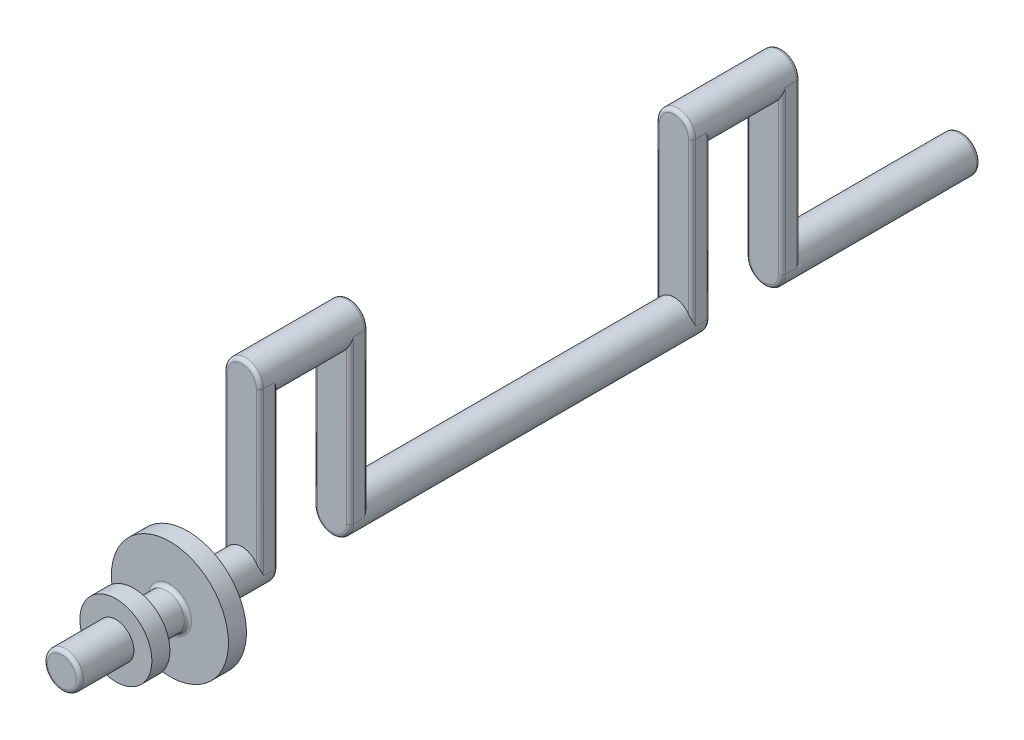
ISO-10303-21;
HEADER;
FILE_DESCRIPTION(('STEP AP214'),'2;1');
FILE_NAME('part.step','',(''),(''),'','','');
FILE_SCHEMA(('AUTOMOTIVE_DESIGN { 1 0 10303 214 1 1 1 1 }'));
ENDSEC;
DATA;
#1=APPLICATION_CONTEXT('core data for automotive mechanical design processes');
#2=APPLICATION_PROTOCOL_DEFINITION('international standard','automotive_design',2000,#1);
#3=PRODUCT_CONTEXT('',#1,'mechanical');
#4=PRODUCT('Part','Part','',(#3));
#5=PRODUCT_RELATED_PRODUCT_CATEGORY('part','',(#4));
#6=PRODUCT_DEFINITION_FORMATION('','',#4);
#7=PRODUCT_DEFINITION_CONTEXT('part definition',#1,'design');
#8=PRODUCT_DEFINITION('design','',#6,#7);
#9=PRODUCT_DEFINITION_SHAPE('','',#8);
#10=(LENGTH_UNIT() NAMED_UNIT(*) SI_UNIT(.MILLI.,.METRE.));
#11=(NAMED_UNIT(*) PLANE_ANGLE_UNIT() SI_UNIT($,.RADIAN.));
#12=(NAMED_UNIT(*) SI_UNIT($,.STERADIAN.) SOLID_ANGLE_UNIT());
#13=UNCERTAINTY_MEASURE_WITH_UNIT(LENGTH_MEASURE(1.E-05),#10,'distance_accuracy_value','');
#14=(GEOMETRIC_REPRESENTATION_CONTEXT(3) GLOBAL_UNCERTAINTY_ASSIGNED_CONTEXT((#13)) GLOBAL_UNIT_ASSIGNED_CONTEXT((#10,
#11,#12)) REPRESENTATION_CONTEXT('',''));
#15=CARTESIAN_POINT('',(0.,0.,0.));
#16=DIRECTION('',(0.,0.,1.));
#17=DIRECTION('',(1.,0.,0.));
#18=AXIS2_PLACEMENT_3D('',#15,#16,#17);
#19=CARTESIAN_POINT('',(0.,0.,150.));
#20=DIRECTION('',(0.,0.,-1.));
#21=DIRECTION('',(-1.,0.,0.));
#22=AXIS2_PLACEMENT_3D('',#19,#20,#21);
#23=CYLINDRICAL_SURFACE('',#22,9.99999999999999);
#24=CARTESIAN_POINT('',(0.,0.,192.));
#25=DIRECTION('',(0.,0.,-1.));
#26=DIRECTION('',(-1.,0.,0.));
#27=AXIS2_PLACEMENT_3D('',#24,#25,#26);
#28=CIRCLE('',#27,9.99999999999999);
#29=CARTESIAN_POINT('',(-9.99999999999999,0.,192.));
#30=VERTEX_POINT('',#29);
#31=EDGE_CURVE('E410',#30,#30,#28,.F.);
#32=ORIENTED_EDGE('',*,*,#31,.T.);
#33=EDGE_LOOP('',(#32));
#34=FACE_BOUND('',#33,.T.);
#35=CARTESIAN_POINT('',(0.,0.,210.));
#36=DIRECTION('',(0.,0.,1.));
#37=DIRECTION('',(1.,0.,0.));
#38=AXIS2_PLACEMENT_3D('',#35,#36,#37);
#39=CIRCLE('',#38,9.99999999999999);
#40=CARTESIAN_POINT('',(9.99999999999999,0.,210.));
#41=VERTEX_POINT('',#40);
#42=EDGE_CURVE('E11',#41,#41,#39,.T.);
#43=ORIENTED_EDGE('',*,*,#42,.F.);
#44=EDGE_LOOP('',(#43));
#45=FACE_BOUND('',#44,.T.);
#46=ADVANCED_FACE('F36',(#34,#45),#23,.T.);
#47=CARTESIAN_POINT('',(0.,-42.1040570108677,-150.));
#48=DIRECTION('',(0.,0.,-1.));
#49=DIRECTION('',(1.,0.,0.));
#50=AXIS2_PLACEMENT_3D('',#47,#48,#49);
#51=PLANE('',#50);
#52=CARTESIAN_POINT('',(0.,0.,-150.));
#53=DIRECTION('',(0.,0.,1.));
#54=DIRECTION('',(1.,0.,0.));
#55=AXIS2_PLACEMENT_3D('',#52,#53,#54);
#56=CIRCLE('',#55,9.99999999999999);
#57=CARTESIAN_POINT('',(7.99999999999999,6.,-150.));
#58=VERTEX_POINT('',#57);
#59=CARTESIAN_POINT('',(-7.99999999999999,6.,-150.));
#60=VERTEX_POINT('',#59);
#61=EDGE_CURVE('E293',#58,#60,#56,.T.);
#62=ORIENTED_EDGE('',*,*,#61,.T.);
#63=DIRECTION('',(0.,-1.,0.));
#64=VECTOR('',#63,1.);
#65=CARTESIAN_POINT('',(-7.99999999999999,-42.1040570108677,-150.));
#66=LINE('',#65,#64);
#67=CARTESIAN_POINT('',(-8.,90.,-150.));
#68=VERTEX_POINT('',#67);
#69=EDGE_CURVE('E350',#60,#68,#66,.F.);
#70=ORIENTED_EDGE('',*,*,#69,.T.);
#71=CARTESIAN_POINT('',(0.,90.,-150.));
#72=DIRECTION('',(0.,0.,-1.));
#73=DIRECTION('',(-1.,0.,0.));
#74=AXIS2_PLACEMENT_3D('',#71,#72,#73);
#75=CIRCLE('',#74,8.);
#76=CARTESIAN_POINT('',(8.,90.,-150.));
#77=VERTEX_POINT('',#76);
#78=EDGE_CURVE('E278',#68,#77,#75,.T.);
#79=ORIENTED_EDGE('',*,*,#78,.T.);
#80=DIRECTION('',(0.,1.,0.));
#81=VECTOR('',#80,1.);
#82=CARTESIAN_POINT('',(7.99999999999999,-42.1040570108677,-150.));
#83=LINE('',#82,#81);
#84=EDGE_CURVE('E286',#77,#58,#83,.F.);
#85=ORIENTED_EDGE('',*,*,#84,.T.);
#86=EDGE_LOOP('',(#62,#70,#79,#85));
#87=FACE_BOUND('',#86,.T.);
#88=ADVANCED_FACE('F837',(#87),#51,.T.);
#89=CARTESIAN_POINT('',(0.,-42.1040570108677,-100.));
#90=DIRECTION('',(0.,0.,-1.));
#91=DIRECTION('',(1.,0.,0.));
#92=AXIS2_PLACEMENT_3D('',#89,#90,#91);
#93=PLANE('',#92);
#94=CARTESIAN_POINT('',(0.,0.,-100.));
#95=DIRECTION('',(0.,0.,-1.));
#96=DIRECTION('',(-1.,0.,0.));
#97=AXIS2_PLACEMENT_3D('',#94,#95,#96);
#98=CIRCLE('',#97,8.);
#99=CARTESIAN_POINT('',(8.,0.,-100.));
#100=VERTEX_POINT('',#99);
#101=CARTESIAN_POINT('',(-8.,0.,-100.));
#102=VERTEX_POINT('',#101);
#103=EDGE_CURVE('E1414',#100,#102,#98,.T.);
#104=ORIENTED_EDGE('',*,*,#103,.T.);
#105=DIRECTION('',(0.,-1.,0.));
#106=VECTOR('',#105,1.);
#107=CARTESIAN_POINT('',(-7.99999999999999,-42.1040570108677,-100.));
#108=LINE('',#107,#106);
#109=CARTESIAN_POINT('',(-8.,84.,-100.));
#110=VERTEX_POINT('',#109);
#111=EDGE_CURVE('E1416',#102,#110,#108,.F.);
#112=ORIENTED_EDGE('',*,*,#111,.T.);
#113=CARTESIAN_POINT('',(0.,90.,-100.));
#114=DIRECTION('',(0.,0.,1.));
#115=DIRECTION('',(1.,0.,0.));
#116=AXIS2_PLACEMENT_3D('',#113,#114,#115);
#117=CIRCLE('',#116,10.);
#118=CARTESIAN_POINT('',(8.,84.,-100.));
#119=VERTEX_POINT('',#118);
#120=EDGE_CURVE('E289',#110,#119,#117,.T.);
#121=ORIENTED_EDGE('',*,*,#120,.T.);
#122=DIRECTION('',(0.,1.,0.));
#123=VECTOR('',#122,1.);
#124=CARTESIAN_POINT('',(7.99999999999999,-42.1040570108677,-100.));
#125=LINE('',#124,#123);
#126=EDGE_CURVE('E1419',#119,#100,#125,.F.);
#127=ORIENTED_EDGE('',*,*,#126,.T.);
#128=EDGE_LOOP('',(#104,#112,#121,#127));
#129=FACE_BOUND('',#128,.T.);
#130=ADVANCED_FACE('F844',(#129),#93,.T.);
#131=CARTESIAN_POINT('',(0.,0.,90.));
#132=DIRECTION('',(0.,0.,-1.));
#133=DIRECTION('',(-1.,0.,0.));
#134=AXIS2_PLACEMENT_3D('',#131,#132,#133);
#135=CYLINDRICAL_SURFACE('',#134,10.);
#136=DIRECTION('',(0.,0.,-1.));
#137=VECTOR('',#136,1.);
#138=CARTESIAN_POINT('',(9.99999999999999,0.,100.));
#139=LINE('',#138,#137);
#140=CARTESIAN_POINT('',(9.99999999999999,0.,98.));
#141=VERTEX_POINT('',#140);
#142=CARTESIAN_POINT('',(9.99999999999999,0.,92.));
#143=VERTEX_POINT('',#142);
#144=EDGE_CURVE('E453',#141,#143,#139,.T.);
#145=ORIENTED_EDGE('',*,*,#144,.F.);
#146=CARTESIAN_POINT('',(0.,0.,98.));
#147=DIRECTION('',(0.,0.,1.));
#148=DIRECTION('',(1.,0.,0.));
#149=AXIS2_PLACEMENT_3D('',#146,#147,#148);
#150=CIRCLE('',#149,10.);
#151=CARTESIAN_POINT('',(-9.99999999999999,0.,98.));
#152=VERTEX_POINT('',#151);
#153=EDGE_CURVE('E592',#141,#152,#150,.F.);
#154=ORIENTED_EDGE('',*,*,#153,.T.);
#155=DIRECTION('',(0.,0.,-1.));
#156=VECTOR('',#155,1.);
#157=CARTESIAN_POINT('',(-9.99999999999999,0.,100.));
#158=LINE('',#157,#156);
#159=CARTESIAN_POINT('',(-9.99999999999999,0.,92.));
#160=VERTEX_POINT('',#159);
#161=EDGE_CURVE('E508',#152,#160,#158,.T.);
#162=ORIENTED_EDGE('',*,*,#161,.T.);
#163=CARTESIAN_POINT('',(-7.99999999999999,6.00000000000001,90.));
#164=CARTESIAN_POINT('',(-8.04728628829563,5.93695362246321,90.0000045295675));
#165=CARTESIAN_POINT('',(-8.09381347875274,5.87336242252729,90.0016763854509));
#166=CARTESIAN_POINT('',(-8.18526953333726,5.74521994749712,90.0080714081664));
#167=CARTESIAN_POINT('',(-8.23019889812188,5.68066898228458,90.0127936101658));
#168=CARTESIAN_POINT('',(-8.3623378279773,5.48597031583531,90.0310882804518));
#169=CARTESIAN_POINT('',(-8.44708785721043,5.35452381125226,90.0487911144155));
#170=CARTESIAN_POINT('',(-8.60911903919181,5.0898913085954,90.0931747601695));
#171=CARTESIAN_POINT('',(-8.68644690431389,4.95672312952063,90.1197939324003));
#172=CARTESIAN_POINT('',(-8.83425262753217,4.68822829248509,90.1805475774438));
#173=CARTESIAN_POINT('',(-8.90472593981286,4.55290027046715,90.214686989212));
#174=CARTESIAN_POINT('',(-9.08147710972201,4.19386066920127,90.3129369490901));
#175=CARTESIAN_POINT('',(-9.18198793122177,3.968727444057,90.3822917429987));
#176=CARTESIAN_POINT('',(-9.36495514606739,3.51531575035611,90.5333799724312));
#177=CARTESIAN_POINT('',(-9.44740386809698,3.28703598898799,90.6151186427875));
#178=CARTESIAN_POINT('',(-9.59501524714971,2.82739571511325,90.7880205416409));
#179=CARTESIAN_POINT('',(-9.66010929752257,2.59602666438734,90.8792192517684));
#180=CARTESIAN_POINT('',(-9.77303511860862,2.13185849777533,91.0680948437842));
#181=CARTESIAN_POINT('',(-9.82087242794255,1.89905986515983,91.165769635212));
#182=CARTESIAN_POINT('',(-9.9065704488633,1.39179187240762,91.3828444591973));
#183=CARTESIAN_POINT('',(-9.94123736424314,1.11713414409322,91.5030630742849));
#184=CARTESIAN_POINT('',(-9.98766939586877,0.567702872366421,91.7461428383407));
#185=CARTESIAN_POINT('',(-9.99948198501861,0.292930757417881,91.8689979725));
#186=CARTESIAN_POINT('',(-9.99999444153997,0.0121715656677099,91.9945567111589));
#187=CARTESIAN_POINT('',(-9.9999999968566,0.00608575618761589,91.9972783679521));
#188=CARTESIAN_POINT('',(-10.,0.,92.));
#189=B_SPLINE_CURVE_WITH_KNOTS('',3,(#163,#164,#165,#166,#167,#168,#169,#170,#171,#172,#173,
#174,#175,#176,#177,#178,#179,#180,#181,#182,#183,#184,#185,#186,#187,#188),.UNSPECIFIED.,.F.,
.F.,(4,2,2,2,2,2,2,2,2,2,2,2,4),(0.,0.236371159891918,0.472667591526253,0.944315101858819,
1.41276713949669,1.88152775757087,2.64870335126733,3.41620414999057,4.18669550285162,
4.95693934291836,5.86148159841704,6.76414291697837,6.78414292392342),.UNSPECIFIED.);
#190=CARTESIAN_POINT('',(-7.99999999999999,6.00000000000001,90.));
#191=VERTEX_POINT('',#190);
#192=EDGE_CURVE('E791',#160,#191,#189,.F.);
#193=ORIENTED_EDGE('',*,*,#192,.T.);
#194=CARTESIAN_POINT('',(0.,0.,90.));
#195=DIRECTION('',(0.,0.,1.));
#196=DIRECTION('',(1.,0.,0.));
#197=AXIS2_PLACEMENT_3D('',#194,#195,#196);
#198=CIRCLE('',#197,10.);
#199=CARTESIAN_POINT('',(7.99999999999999,6.00000000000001,90.));
#200=VERTEX_POINT('',#199);
#201=EDGE_CURVE('E475',#200,#191,#198,.T.);
#202=ORIENTED_EDGE('',*,*,#201,.F.);
#203=CARTESIAN_POINT('',(7.99999999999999,6.00000000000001,90.));
#204=CARTESIAN_POINT('',(8.04728628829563,5.93695362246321,90.0000045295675));
#205=CARTESIAN_POINT('',(8.09381347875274,5.87336242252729,90.0016763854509));
#206=CARTESIAN_POINT('',(8.18526953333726,5.74521994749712,90.0080714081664));
#207=CARTESIAN_POINT('',(8.23019889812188,5.68066898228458,90.0127936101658));
#208=CARTESIAN_POINT('',(8.3623378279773,5.48597031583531,90.0310882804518));
#209=CARTESIAN_POINT('',(8.44708785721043,5.35452381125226,90.0487911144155));
#210=CARTESIAN_POINT('',(8.60911903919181,5.0898913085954,90.0931747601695));
#211=CARTESIAN_POINT('',(8.68644690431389,4.95672312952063,90.1197939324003));
#212=CARTESIAN_POINT('',(8.83425262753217,4.68822829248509,90.1805475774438));
#213=CARTESIAN_POINT('',(8.90472593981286,4.55290027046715,90.214686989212));
#214=CARTESIAN_POINT('',(9.08147710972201,4.19386066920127,90.3129369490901));
#215=CARTESIAN_POINT('',(9.18198793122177,3.968727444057,90.3822917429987));
#216=CARTESIAN_POINT('',(9.36495514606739,3.51531575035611,90.5333799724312));
#217=CARTESIAN_POINT('',(9.44740386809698,3.28703598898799,90.6151186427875));
#218=CARTESIAN_POINT('',(9.59501524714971,2.82739571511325,90.7880205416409));
#219=CARTESIAN_POINT('',(9.66010929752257,2.59602666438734,90.8792192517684));
#220=CARTESIAN_POINT('',(9.77303511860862,2.13185849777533,91.0680948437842));
#221=CARTESIAN_POINT('',(9.82087242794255,1.89905986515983,91.165769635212));
#222=CARTESIAN_POINT('',(9.9065704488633,1.39179187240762,91.3828444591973));
#223=CARTESIAN_POINT('',(9.94123736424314,1.11713414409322,91.5030630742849));
#224=CARTESIAN_POINT('',(9.98766939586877,0.567702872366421,91.7461428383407));
#225=CARTESIAN_POINT('',(9.99948198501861,0.292930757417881,91.8689979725));
#226=CARTESIAN_POINT('',(9.99999444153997,0.0121715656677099,91.9945567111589));
#227=CARTESIAN_POINT('',(9.9999999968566,0.00608575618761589,91.9972783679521));
#228=CARTESIAN_POINT('',(10.,0.,92.));
#229=B_SPLINE_CURVE_WITH_KNOTS('',3,(#203,#204,#205,#206,#207,#208,#209,#210,#211,#212,#213,
#214,#215,#216,#217,#218,#219,#220,#221,#222,#223,#224,#225,#226,#227,#228),.UNSPECIFIED.,.F.,
.F.,(4,2,2,2,2,2,2,2,2,2,2,2,4),(0.,0.236371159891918,0.472667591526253,0.944315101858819,
1.41276713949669,1.88152775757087,2.64870335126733,3.41620414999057,4.18669550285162,
4.95693934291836,5.86148159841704,6.76414291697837,6.78414292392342),.UNSPECIFIED.);
#230=EDGE_CURVE('E785',#200,#143,#229,.T.);
#231=ORIENTED_EDGE('',*,*,#230,.T.);
#232=EDGE_LOOP('',(#145,#154,#162,#193,#202,#231));
#233=FACE_BOUND('',#232,.T.);
#234=DIRECTION('',(0.,0.,1.));
#235=VECTOR('',#234,1.);
#236=CARTESIAN_POINT('',(-9.99999999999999,0.,-100.));
#237=LINE('',#236,#235);
#238=CARTESIAN_POINT('',(-9.99999999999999,0.,-98.));
#239=VERTEX_POINT('',#238);
#240=CARTESIAN_POINT('',(-9.99999999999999,0.,-92.));
#241=VERTEX_POINT('',#240);
#242=EDGE_CURVE('E319',#239,#241,#237,.T.);
#243=ORIENTED_EDGE('',*,*,#242,.F.);
#244=CARTESIAN_POINT('',(0.,0.,-98.));
#245=DIRECTION('',(0.,0.,-1.));
#246=DIRECTION('',(-1.,0.,0.));
#247=AXIS2_PLACEMENT_3D('',#244,#245,#246);
#248=CIRCLE('',#247,10.);
#249=CARTESIAN_POINT('',(9.99999999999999,0.,-98.));
#250=VERTEX_POINT('',#249);
#251=EDGE_CURVE('E594',#239,#250,#248,.F.);
#252=ORIENTED_EDGE('',*,*,#251,.T.);
#253=DIRECTION('',(0.,0.,1.));
#254=VECTOR('',#253,1.);
#255=CARTESIAN_POINT('',(9.99999999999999,0.,-100.));
#256=LINE('',#255,#254);
#257=CARTESIAN_POINT('',(9.99999999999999,0.,-92.));
#258=VERTEX_POINT('',#257);
#259=EDGE_CURVE('E323',#250,#258,#256,.T.);
#260=ORIENTED_EDGE('',*,*,#259,.T.);
#261=CARTESIAN_POINT('',(7.99999999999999,6.00000000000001,-90.));
#262=CARTESIAN_POINT('',(8.04728628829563,5.93695362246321,-90.0000045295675));
#263=CARTESIAN_POINT('',(8.09381347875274,5.87336242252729,-90.0016763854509));
#264=CARTESIAN_POINT('',(8.18526953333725,5.74521994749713,-90.0080714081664));
#265=CARTESIAN_POINT('',(8.23019889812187,5.6806689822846,-90.0127936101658));
#266=CARTESIAN_POINT('',(8.36233782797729,5.48597031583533,-90.0310882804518));
#267=CARTESIAN_POINT('',(8.44708785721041,5.35452381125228,-90.0487911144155));
#268=CARTESIAN_POINT('',(8.6091190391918,5.08989130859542,-90.0931747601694));
#269=CARTESIAN_POINT('',(8.68644690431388,4.95672312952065,-90.1197939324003));
#270=CARTESIAN_POINT('',(8.83425262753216,4.6882282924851,-90.1805475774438));
#271=CARTESIAN_POINT('',(8.90472593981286,4.55290027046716,-90.214686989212));
#272=CARTESIAN_POINT('',(9.08147710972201,4.19386066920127,-90.3129369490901));
#273=CARTESIAN_POINT('',(9.18198793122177,3.968727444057,-90.3822917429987));
#274=CARTESIAN_POINT('',(9.36495514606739,3.51531575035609,-90.5333799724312));
#275=CARTESIAN_POINT('',(9.44740386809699,3.28703598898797,-90.6151186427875));
#276=CARTESIAN_POINT('',(9.59501524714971,2.82739571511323,-90.7880205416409));
#277=CARTESIAN_POINT('',(9.66010929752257,2.59602666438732,-90.8792192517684));
#278=CARTESIAN_POINT('',(9.77303511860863,2.13185849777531,-91.0680948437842));
#279=CARTESIAN_POINT('',(9.82087242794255,1.89905986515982,-91.165769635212));
#280=CARTESIAN_POINT('',(9.9065704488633,1.39179187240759,-91.3828444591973));
#281=CARTESIAN_POINT('',(9.94123736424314,1.11713414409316,-91.5030630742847));
#282=CARTESIAN_POINT('',(9.98766939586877,0.567702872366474,-91.7461428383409));
#283=CARTESIAN_POINT('',(9.99948198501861,0.292930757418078,-91.8689979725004));
#284=CARTESIAN_POINT('',(9.99999444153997,0.0121715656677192,-91.9945567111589));
#285=CARTESIAN_POINT('',(9.9999999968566,0.00608575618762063,-91.9972783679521));
#286=CARTESIAN_POINT('',(10.,0.,-92.));
#287=B_SPLINE_CURVE_WITH_KNOTS('',3,(#261,#262,#263,#264,#265,#266,#267,#268,#269,#270,#271,
#272,#273,#274,#275,#276,#277,#278,#279,#280,#281,#282,#283,#284,#285,#286),.UNSPECIFIED.,.F.,
.F.,(4,2,2,2,2,2,2,2,2,2,2,2,4),(0.,0.236371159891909,0.472667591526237,0.944315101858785,
1.41276713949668,1.88152775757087,2.64870335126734,3.41620414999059,4.18669550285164,
4.95693934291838,5.86148159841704,6.76414291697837,6.78414292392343),.UNSPECIFIED.);
#288=CARTESIAN_POINT('',(7.99999999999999,6.00000000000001,-90.));
#289=VERTEX_POINT('',#288);
#290=EDGE_CURVE('E687',#258,#289,#287,.F.);
#291=ORIENTED_EDGE('',*,*,#290,.T.);
#292=CARTESIAN_POINT('',(0.,0.,-90.));
#293=DIRECTION('',(0.,0.,1.));
#294=DIRECTION('',(1.,0.,0.));
#295=AXIS2_PLACEMENT_3D('',#292,#293,#294);
#296=CIRCLE('',#295,10.);
#297=CARTESIAN_POINT('',(-7.99999999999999,6.00000000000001,-90.));
#298=VERTEX_POINT('',#297);
#299=EDGE_CURVE('E471',#289,#298,#296,.T.);
#300=ORIENTED_EDGE('',*,*,#299,.T.);
#301=CARTESIAN_POINT('',(-7.99999999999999,6.00000000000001,-90.));
#302=CARTESIAN_POINT('',(-8.04728628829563,5.93695362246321,-90.0000045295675));
#303=CARTESIAN_POINT('',(-8.09381347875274,5.87336242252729,-90.0016763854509));
#304=CARTESIAN_POINT('',(-8.18526953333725,5.74521994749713,-90.0080714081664));
#305=CARTESIAN_POINT('',(-8.23019889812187,5.6806689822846,-90.0127936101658));
#306=CARTESIAN_POINT('',(-8.36233782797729,5.48597031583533,-90.0310882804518));
#307=CARTESIAN_POINT('',(-8.44708785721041,5.35452381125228,-90.0487911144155));
#308=CARTESIAN_POINT('',(-8.6091190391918,5.08989130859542,-90.0931747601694));
#309=CARTESIAN_POINT('',(-8.68644690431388,4.95672312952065,-90.1197939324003));
#310=CARTESIAN_POINT('',(-8.83425262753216,4.6882282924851,-90.1805475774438));
#311=CARTESIAN_POINT('',(-8.90472593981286,4.55290027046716,-90.214686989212));
#312=CARTESIAN_POINT('',(-9.08147710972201,4.19386066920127,-90.3129369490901));
#313=CARTESIAN_POINT('',(-9.18198793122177,3.968727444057,-90.3822917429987));
#314=CARTESIAN_POINT('',(-9.36495514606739,3.51531575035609,-90.5333799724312));
#315=CARTESIAN_POINT('',(-9.44740386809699,3.28703598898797,-90.6151186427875));
#316=CARTESIAN_POINT('',(-9.59501524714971,2.82739571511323,-90.7880205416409));
#317=CARTESIAN_POINT('',(-9.66010929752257,2.59602666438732,-90.8792192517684));
#318=CARTESIAN_POINT('',(-9.77303511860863,2.13185849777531,-91.0680948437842));
#319=CARTESIAN_POINT('',(-9.82087242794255,1.89905986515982,-91.165769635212));
#320=CARTESIAN_POINT('',(-9.9065704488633,1.39179187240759,-91.3828444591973));
#321=CARTESIAN_POINT('',(-9.94123736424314,1.11713414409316,-91.5030630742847));
#322=CARTESIAN_POINT('',(-9.98766939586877,0.567702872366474,-91.7461428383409));
#323=CARTESIAN_POINT('',(-9.99948198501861,0.292930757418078,-91.8689979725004));
#324=CARTESIAN_POINT('',(-9.99999444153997,0.0121715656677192,-91.9945567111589));
#325=CARTESIAN_POINT('',(-9.9999999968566,0.00608575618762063,-91.9972783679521));
#326=CARTESIAN_POINT('',(-10.,0.,-92.));
#327=B_SPLINE_CURVE_WITH_KNOTS('',3,(#301,#302,#303,#304,#305,#306,#307,#308,#309,#310,#311,
#312,#313,#314,#315,#316,#317,#318,#319,#320,#321,#322,#323,#324,#325,#326),.UNSPECIFIED.,.F.,
.F.,(4,2,2,2,2,2,2,2,2,2,2,2,4),(0.,0.236371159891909,0.472667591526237,0.944315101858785,
1.41276713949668,1.88152775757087,2.64870335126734,3.41620414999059,4.18669550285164,
4.95693934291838,5.86148159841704,6.76414291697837,6.78414292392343),.UNSPECIFIED.);
#328=EDGE_CURVE('E718',#298,#241,#327,.T.);
#329=ORIENTED_EDGE('',*,*,#328,.T.);
#330=EDGE_LOOP('',(#243,#252,#260,#291,#300,#329));
#331=FACE_BOUND('',#330,.T.);
#332=ADVANCED_FACE('F629',(#233,#331),#135,.T.);
#333=CARTESIAN_POINT('',(0.,-42.1040570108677,90.));
#334=DIRECTION('',(0.,0.,1.));
#335=DIRECTION('',(1.,0.,0.));
#336=AXIS2_PLACEMENT_3D('',#333,#334,#335);
#337=PLANE('',#336);
#338=CARTESIAN_POINT('',(0.,90.,90.));
#339=DIRECTION('',(0.,0.,1.));
#340=DIRECTION('',(1.,0.,0.));
#341=AXIS2_PLACEMENT_3D('',#338,#339,#340);
#342=CIRCLE('',#341,8.);
#343=CARTESIAN_POINT('',(-8.,90.,90.));
#344=VERTEX_POINT('',#343);
#345=CARTESIAN_POINT('',(8.,90.,90.));
#346=VERTEX_POINT('',#345);
#347=EDGE_CURVE('E522',#344,#346,#342,.F.);
#348=ORIENTED_EDGE('',*,*,#347,.T.);
#349=DIRECTION('',(0.,1.,0.));
#350=VECTOR('',#349,1.);
#351=CARTESIAN_POINT('',(7.99999999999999,-42.1040570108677,90.));
#352=LINE('',#351,#350);
#353=EDGE_CURVE('E526',#346,#200,#352,.F.);
#354=ORIENTED_EDGE('',*,*,#353,.T.);
#355=ORIENTED_EDGE('',*,*,#201,.T.);
#356=DIRECTION('',(0.,-1.,0.));
#357=VECTOR('',#356,1.);
#358=CARTESIAN_POINT('',(-7.99999999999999,-42.1040570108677,90.));
#359=LINE('',#358,#357);
#360=EDGE_CURVE('E524',#191,#344,#359,.F.);
#361=ORIENTED_EDGE('',*,*,#360,.T.);
#362=EDGE_LOOP('',(#348,#354,#355,#361));
#363=FACE_BOUND('',#362,.T.);
#364=ADVANCED_FACE('F892',(#363),#337,.F.);
#365=CARTESIAN_POINT('',(9.99999999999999,-42.1040570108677,100.));
#366=DIRECTION('',(-1.,0.,0.));
#367=DIRECTION('',(0.,-1.,0.));
#368=AXIS2_PLACEMENT_3D('',#365,#366,#367);
#369=PLANE('',#368);
#370=DIRECTION('',(0.,0.,-1.));
#371=VECTOR('',#370,1.);
#372=CARTESIAN_POINT('',(10.,90.,100.));
#373=LINE('',#372,#371);
#374=CARTESIAN_POINT('',(10.,90.,98.));
#375=VERTEX_POINT('',#374);
#376=CARTESIAN_POINT('',(10.,90.,92.));
#377=VERTEX_POINT('',#376);
#378=EDGE_CURVE('E476',#375,#377,#373,.T.);
#379=ORIENTED_EDGE('',*,*,#378,.F.);
#380=DIRECTION('',(0.,1.,0.));
#381=VECTOR('',#380,1.);
#382=CARTESIAN_POINT('',(9.99999999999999,0.,98.));
#383=LINE('',#382,#381);
#384=EDGE_CURVE('E460',#375,#141,#383,.F.);
#385=ORIENTED_EDGE('',*,*,#384,.T.);
#386=ORIENTED_EDGE('',*,*,#144,.T.);
#387=DIRECTION('',(0.,1.,0.));
#388=VECTOR('',#387,1.);
#389=CARTESIAN_POINT('',(9.99999999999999,-42.1040570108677,92.));
#390=LINE('',#389,#388);
#391=EDGE_CURVE('E509',#143,#377,#390,.T.);
#392=ORIENTED_EDGE('',*,*,#391,.T.);
#393=EDGE_LOOP('',(#379,#385,#386,#392));
#394=FACE_BOUND('',#393,.T.);
#395=ADVANCED_FACE('F742',(#394),#369,.F.);
#396=CARTESIAN_POINT('',(0.,90.,100.));
#397=DIRECTION('',(0.,0.,-1.));
#398=DIRECTION('',(-1.,0.,0.));
#399=AXIS2_PLACEMENT_3D('',#396,#397,#398);
#400=CYLINDRICAL_SURFACE('',#399,10.);
#401=ORIENTED_EDGE('',*,*,#378,.T.);
#402=CARTESIAN_POINT('',(0.,90.,92.));
#403=DIRECTION('',(0.,0.,1.));
#404=DIRECTION('',(1.,0.,0.));
#405=AXIS2_PLACEMENT_3D('',#402,#403,#404);
#406=CIRCLE('',#405,10.);
#407=CARTESIAN_POINT('',(-10.,90.,92.));
#408=VERTEX_POINT('',#407);
#409=EDGE_CURVE('E604',#377,#408,#406,.T.);
#410=ORIENTED_EDGE('',*,*,#409,.T.);
#411=DIRECTION('',(0.,0.,-1.));
#412=VECTOR('',#411,1.);
#413=CARTESIAN_POINT('',(-10.,90.,100.));
#414=LINE('',#413,#412);
#415=CARTESIAN_POINT('',(-10.,90.,98.));
#416=VERTEX_POINT('',#415);
#417=EDGE_CURVE('E504',#416,#408,#414,.T.);
#418=ORIENTED_EDGE('',*,*,#417,.F.);
#419=CARTESIAN_POINT('',(-8.,84.,100.));
#420=CARTESIAN_POINT('',(-8.04728628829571,84.0630463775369,99.9999954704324));
#421=CARTESIAN_POINT('',(-8.09381347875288,84.1266375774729,99.9983236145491));
#422=CARTESIAN_POINT('',(-8.18526953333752,84.2547800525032,99.9919285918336));
#423=CARTESIAN_POINT('',(-8.23019889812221,84.3193310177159,99.9872063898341));
#424=CARTESIAN_POINT('',(-8.36233782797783,84.5140296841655,99.9689117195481));
#425=CARTESIAN_POINT('',(-8.44708785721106,84.6454761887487,99.9512088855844));
#426=CARTESIAN_POINT('',(-8.60911903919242,84.9101086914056,99.9068252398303));
#427=CARTESIAN_POINT('',(-8.68644690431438,85.0432768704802,99.8802060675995));
#428=CARTESIAN_POINT('',(-8.83425262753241,85.3117717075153,99.8194524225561));
#429=CARTESIAN_POINT('',(-8.90472593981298,85.4470997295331,99.7853130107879));
#430=CARTESIAN_POINT('',(-9.08147710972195,85.8061393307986,99.6870630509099));
#431=CARTESIAN_POINT('',(-9.18198793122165,86.0312725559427,99.6177082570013));
#432=CARTESIAN_POINT('',(-9.36495514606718,86.4846842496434,99.466620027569));
#433=CARTESIAN_POINT('',(-9.44740386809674,86.7129640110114,99.3848813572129));
#434=CARTESIAN_POINT('',(-9.59501524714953,87.1726042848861,99.2119794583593));
#435=CARTESIAN_POINT('',(-9.66010929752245,87.403973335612,99.1207807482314));
#436=CARTESIAN_POINT('',(-9.77303511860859,87.8681415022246,98.9319051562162));
#437=CARTESIAN_POINT('',(-9.82087242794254,88.1009401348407,98.8342303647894));
#438=CARTESIAN_POINT('',(-9.90657044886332,88.6082081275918,98.6171555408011));
#439=CARTESIAN_POINT('',(-9.94123736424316,88.882865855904,98.4969369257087));
#440=CARTESIAN_POINT('',(-9.98766939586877,89.4322971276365,98.2538571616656));
#441=CARTESIAN_POINT('',(-9.99948198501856,89.7070692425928,98.131002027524));
#442=CARTESIAN_POINT('',(-9.99999444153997,89.9878284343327,98.0054432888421));
#443=CARTESIAN_POINT('',(-9.9999999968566,89.9939142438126,98.0027216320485));
#444=CARTESIAN_POINT('',(-10.,90.,98.));
#445=B_SPLINE_CURVE_WITH_KNOTS('',3,(#419,#420,#421,#422,#423,#424,#425,#426,#427,#428,#429,
#430,#431,#432,#433,#434,#435,#436,#437,#438,#439,#440,#441,#442,#443,#444),.UNSPECIFIED.,.F.,
.F.,(4,2,2,2,2,2,2,2,2,2,2,2,4),(0.,0.236371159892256,0.472667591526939,0.944315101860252,
1.41276713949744,1.88152775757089,2.64870335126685,3.41620414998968,4.18669550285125,
4.95693934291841,5.86148159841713,6.76414291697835,6.78414292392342),.UNSPECIFIED.);
#446=CARTESIAN_POINT('',(-8.,84.,100.));
#447=VERTEX_POINT('',#446);
#448=EDGE_CURVE('E724',#416,#447,#445,.F.);
#449=ORIENTED_EDGE('',*,*,#448,.T.);
#450=CARTESIAN_POINT('',(0.,90.,100.));
#451=DIRECTION('',(0.,0.,1.));
#452=DIRECTION('',(1.,0.,0.));
#453=AXIS2_PLACEMENT_3D('',#450,#451,#452);
#454=CIRCLE('',#453,10.);
#455=CARTESIAN_POINT('',(8.,84.,100.));
#456=VERTEX_POINT('',#455);
#457=EDGE_CURVE('E339',#447,#456,#454,.T.);
#458=ORIENTED_EDGE('',*,*,#457,.T.);
#459=CARTESIAN_POINT('',(8.,84.,100.));
#460=CARTESIAN_POINT('',(8.04728628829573,84.0630463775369,99.9999954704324));
#461=CARTESIAN_POINT('',(8.09381347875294,84.126637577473,99.9983236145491));
#462=CARTESIAN_POINT('',(8.18526953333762,84.2547800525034,99.9919285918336));
#463=CARTESIAN_POINT('',(8.23019889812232,84.3193310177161,99.9872063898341));
#464=CARTESIAN_POINT('',(8.36233782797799,84.5140296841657,99.9689117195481));
#465=CARTESIAN_POINT('',(8.44708785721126,84.6454761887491,99.9512088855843));
#466=CARTESIAN_POINT('',(8.60911903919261,84.910108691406,99.9068252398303));
#467=CARTESIAN_POINT('',(8.68644690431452,85.0432768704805,99.8802060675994));
#468=CARTESIAN_POINT('',(8.83425262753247,85.3117717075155,99.8194524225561));
#469=CARTESIAN_POINT('',(8.90472593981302,85.4470997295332,99.7853130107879));
#470=CARTESIAN_POINT('',(9.08147710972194,85.8061393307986,99.6870630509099));
#471=CARTESIAN_POINT('',(9.18198793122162,86.0312725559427,99.6177082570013));
#472=CARTESIAN_POINT('',(9.36495514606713,86.4846842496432,99.466620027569));
#473=CARTESIAN_POINT('',(9.44740386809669,86.7129640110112,99.3848813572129));
#474=CARTESIAN_POINT('',(9.59501524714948,87.1726042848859,99.2119794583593));
#475=CARTESIAN_POINT('',(9.66010929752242,87.4039733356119,99.1207807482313));
#476=CARTESIAN_POINT('',(9.77303511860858,87.8681415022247,98.9319051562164));
#477=CARTESIAN_POINT('',(9.82087242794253,88.1009401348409,98.8342303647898));
#478=CARTESIAN_POINT('',(9.90657044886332,88.6082081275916,98.6171555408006));
#479=CARTESIAN_POINT('',(9.94123736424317,88.8828658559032,98.4969369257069));
#480=CARTESIAN_POINT('',(9.98766939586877,89.4322971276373,98.2538571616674));
#481=CARTESIAN_POINT('',(9.99948198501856,89.7070692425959,98.1310020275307));
#482=CARTESIAN_POINT('',(9.99999444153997,89.9878284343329,98.0054432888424));
#483=CARTESIAN_POINT('',(9.9999999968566,89.9939142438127,98.0027216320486));
#484=CARTESIAN_POINT('',(10.,90.,98.));
#485=B_SPLINE_CURVE_WITH_KNOTS('',3,(#459,#460,#461,#462,#463,#464,#465,#466,#467,#468,#469,
#470,#471,#472,#473,#474,#475,#476,#477,#478,#479,#480,#481,#482,#483,#484),.UNSPECIFIED.,.F.,
.F.,(4,2,2,2,2,2,2,2,2,2,2,2,4),(0.,0.236371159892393,0.472667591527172,0.944315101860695,
1.41276713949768,1.88152775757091,2.64870335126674,3.41620414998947,4.1866955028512,
4.95693934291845,5.86148159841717,6.76414291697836,6.78414292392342),.UNSPECIFIED.);
#486=EDGE_CURVE('E590',#456,#375,#485,.T.);
#487=ORIENTED_EDGE('',*,*,#486,.T.);
#488=EDGE_LOOP('',(#401,#410,#418,#449,#458,#487));
#489=FACE_BOUND('',#488,.T.);
#490=DIRECTION('',(0.,0.,-1.));
#491=VECTOR('',#490,1.);
#492=CARTESIAN_POINT('',(-10.,90.,150.));
#493=LINE('',#492,#491);
#494=CARTESIAN_POINT('',(-10.,90.,148.));
#495=VERTEX_POINT('',#494);
#496=CARTESIAN_POINT('',(-10.,90.,142.));
#497=VERTEX_POINT('',#496);
#498=EDGE_CURVE('E462',#495,#497,#493,.T.);
#499=ORIENTED_EDGE('',*,*,#498,.F.);
#500=CARTESIAN_POINT('',(0.,90.,148.));
#501=DIRECTION('',(0.,0.,1.));
#502=DIRECTION('',(1.,0.,0.));
#503=AXIS2_PLACEMENT_3D('',#500,#501,#502);
#504=CIRCLE('',#503,10.);
#505=CARTESIAN_POINT('',(10.,90.,148.));
#506=VERTEX_POINT('',#505);
#507=EDGE_CURVE('E597',#495,#506,#504,.F.);
#508=ORIENTED_EDGE('',*,*,#507,.T.);
#509=DIRECTION('',(0.,0.,-1.));
#510=VECTOR('',#509,1.);
#511=CARTESIAN_POINT('',(10.,90.,150.));
#512=LINE('',#511,#510);
#513=CARTESIAN_POINT('',(10.,90.,142.));
#514=VERTEX_POINT('',#513);
#515=EDGE_CURVE('E455',#506,#514,#512,.T.);
#516=ORIENTED_EDGE('',*,*,#515,.T.);
#517=CARTESIAN_POINT('',(8.,84.,140.));
#518=CARTESIAN_POINT('',(8.04728628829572,84.0630463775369,140.000004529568));
#519=CARTESIAN_POINT('',(8.09381347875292,84.1266375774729,140.001676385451));
#520=CARTESIAN_POINT('',(8.18526953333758,84.2547800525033,140.008071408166));
#521=CARTESIAN_POINT('',(8.23019889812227,84.319331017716,140.012793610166));
#522=CARTESIAN_POINT('',(8.36233782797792,84.5140296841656,140.031088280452));
#523=CARTESIAN_POINT('',(8.44708785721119,84.6454761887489,140.048791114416));
#524=CARTESIAN_POINT('',(8.60911903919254,84.9101086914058,140.09317476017));
#525=CARTESIAN_POINT('',(8.68644690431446,85.0432768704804,140.119793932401));
#526=CARTESIAN_POINT('',(8.83425262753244,85.3117717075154,140.180547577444));
#527=CARTESIAN_POINT('',(8.904725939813,85.4470997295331,140.214686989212));
#528=CARTESIAN_POINT('',(9.08147710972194,85.8061393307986,140.31293694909));
#529=CARTESIAN_POINT('',(9.18198793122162,86.0312725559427,140.382291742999));
#530=CARTESIAN_POINT('',(9.36495514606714,86.4846842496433,140.533379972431));
#531=CARTESIAN_POINT('',(9.44740386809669,86.7129640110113,140.615118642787));
#532=CARTESIAN_POINT('',(9.59501524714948,87.1726042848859,140.788020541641));
#533=CARTESIAN_POINT('',(9.66010929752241,87.4039733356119,140.879219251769));
#534=CARTESIAN_POINT('',(9.77303511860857,87.8681415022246,141.068094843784));
#535=CARTESIAN_POINT('',(9.82087242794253,88.1009401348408,141.16576963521));
#536=CARTESIAN_POINT('',(9.90657044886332,88.6082081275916,141.382844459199));
#537=CARTESIAN_POINT('',(9.94123736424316,88.8828658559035,141.503063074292));
#538=CARTESIAN_POINT('',(9.98766939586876,89.432297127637,141.746142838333));
#539=CARTESIAN_POINT('',(9.99948198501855,89.7070692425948,141.868997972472));
#540=CARTESIAN_POINT('',(9.99999444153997,89.9878284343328,141.994556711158));
#541=CARTESIAN_POINT('',(9.9999999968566,89.9939142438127,141.997278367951));
#542=CARTESIAN_POINT('',(10.,90.,142.));
#543=B_SPLINE_CURVE_WITH_KNOTS('',3,(#517,#518,#519,#520,#521,#522,#523,#524,#525,#526,#527,
#528,#529,#530,#531,#532,#533,#534,#535,#536,#537,#538,#539,#540,#541,#542),.UNSPECIFIED.,.F.,
.F.,(4,2,2,2,2,2,2,2,2,2,2,2,4),(0.,0.236371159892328,0.472667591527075,0.944315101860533,
1.41276713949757,1.88152775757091,2.64870335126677,3.4162041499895,4.18669550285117,
4.95693934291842,5.86148159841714,6.76414291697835,6.78414292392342),.UNSPECIFIED.);
#544=CARTESIAN_POINT('',(7.99999999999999,84.,140.));
#545=VERTEX_POINT('',#544);
#546=EDGE_CURVE('E755',#514,#545,#543,.F.);
#547=ORIENTED_EDGE('',*,*,#546,.T.);
#548=CARTESIAN_POINT('',(0.,90.,140.));
#549=DIRECTION('',(0.,0.,1.));
#550=DIRECTION('',(1.,0.,0.));
#551=AXIS2_PLACEMENT_3D('',#548,#549,#550);
#552=CIRCLE('',#551,10.);
#553=CARTESIAN_POINT('',(-8.,84.,140.));
#554=VERTEX_POINT('',#553);
#555=EDGE_CURVE('E449',#554,#545,#552,.T.);
#556=ORIENTED_EDGE('',*,*,#555,.F.);
#557=CARTESIAN_POINT('',(-8.,84.,140.));
#558=CARTESIAN_POINT('',(-8.04728628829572,84.0630463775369,140.000004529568));
#559=CARTESIAN_POINT('',(-8.0938134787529,84.1266375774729,140.001676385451));
#560=CARTESIAN_POINT('',(-8.18526953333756,84.2547800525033,140.008071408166));
#561=CARTESIAN_POINT('',(-8.23019889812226,84.319331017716,140.012793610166));
#562=CARTESIAN_POINT('',(-8.3623378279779,84.5140296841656,140.031088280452));
#563=CARTESIAN_POINT('',(-8.44708785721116,84.6454761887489,140.048791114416));
#564=CARTESIAN_POINT('',(-8.60911903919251,84.9101086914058,140.09317476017));
#565=CARTESIAN_POINT('',(-8.68644690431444,85.0432768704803,140.119793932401));
#566=CARTESIAN_POINT('',(-8.83425262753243,85.3117717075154,140.180547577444));
#567=CARTESIAN_POINT('',(-8.904725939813,85.4470997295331,140.214686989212));
#568=CARTESIAN_POINT('',(-9.08147710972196,85.8061393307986,140.31293694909));
#569=CARTESIAN_POINT('',(-9.18198793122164,86.0312725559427,140.382291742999));
#570=CARTESIAN_POINT('',(-9.36495514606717,86.4846842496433,140.533379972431));
#571=CARTESIAN_POINT('',(-9.44740386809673,86.7129640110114,140.615118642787));
#572=CARTESIAN_POINT('',(-9.59501524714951,87.172604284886,140.788020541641));
#573=CARTESIAN_POINT('',(-9.66010929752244,87.403973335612,140.879219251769));
#574=CARTESIAN_POINT('',(-9.77303511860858,87.8681415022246,141.068094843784));
#575=CARTESIAN_POINT('',(-9.82087242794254,88.1009401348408,141.16576963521));
#576=CARTESIAN_POINT('',(-9.90657044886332,88.6082081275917,141.382844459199));
#577=CARTESIAN_POINT('',(-9.94123736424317,88.8828658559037,141.503063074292));
#578=CARTESIAN_POINT('',(-9.98766939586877,89.4322971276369,141.746142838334));
#579=CARTESIAN_POINT('',(-9.99948198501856,89.7070692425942,141.868997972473));
#580=CARTESIAN_POINT('',(-9.99999444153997,89.9878284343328,141.994556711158));
#581=CARTESIAN_POINT('',(-9.9999999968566,89.9939142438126,141.997278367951));
#582=CARTESIAN_POINT('',(-10.,90.,142.));
#583=B_SPLINE_CURVE_WITH_KNOTS('',3,(#557,#558,#559,#560,#561,#562,#563,#564,#565,#566,#567,
#568,#569,#570,#571,#572,#573,#574,#575,#576,#577,#578,#579,#580,#581,#582),.UNSPECIFIED.,.F.,
.F.,(4,2,2,2,2,2,2,2,2,2,2,2,4),(0.,0.236371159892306,0.47266759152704,0.944315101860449,
1.41276713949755,1.88152775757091,2.64870335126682,3.41620414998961,4.18669550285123,
4.95693934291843,5.86148159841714,6.76414291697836,6.78414292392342),.UNSPECIFIED.);
#584=EDGE_CURVE('E749',#554,#497,#583,.T.);
#585=ORIENTED_EDGE('',*,*,#584,.T.);
#586=EDGE_LOOP('',(#499,#508,#516,#547,#556,#585));
#587=FACE_BOUND('',#586,.T.);
#588=ADVANCED_FACE('F737',(#489,#587),#400,.T.);
#589=CARTESIAN_POINT('',(-9.99999999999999,-42.1040570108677,100.));
#590=DIRECTION('',(1.,0.,0.));
#591=DIRECTION('',(0.,1.,0.));
#592=AXIS2_PLACEMENT_3D('',#589,#590,#591);
#593=PLANE('',#592);
#594=ORIENTED_EDGE('',*,*,#161,.F.);
#595=DIRECTION('',(0.,-1.,0.));
#596=VECTOR('',#595,1.);
#597=CARTESIAN_POINT('',(-10.,90.,98.));
#598=LINE('',#597,#596);
#599=EDGE_CURVE('E505',#152,#416,#598,.F.);
#600=ORIENTED_EDGE('',*,*,#599,.T.);
#601=ORIENTED_EDGE('',*,*,#417,.T.);
#602=DIRECTION('',(0.,-1.,0.));
#603=VECTOR('',#602,1.);
#604=CARTESIAN_POINT('',(-9.99999999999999,-42.1040570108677,92.));
#605=LINE('',#604,#603);
#606=EDGE_CURVE('E563',#408,#160,#605,.T.);
#607=ORIENTED_EDGE('',*,*,#606,.T.);
#608=EDGE_LOOP('',(#594,#600,#601,#607));
#609=FACE_BOUND('',#608,.T.);
#610=ADVANCED_FACE('F741',(#609),#593,.F.);
#611=CARTESIAN_POINT('',(0.,-42.1040570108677,100.));
#612=DIRECTION('',(0.,0.,1.));
#613=DIRECTION('',(1.,0.,0.));
#614=AXIS2_PLACEMENT_3D('',#611,#612,#613);
#615=PLANE('',#614);
#616=ORIENTED_EDGE('',*,*,#457,.F.);
#617=DIRECTION('',(0.,-1.,0.));
#618=VECTOR('',#617,1.);
#619=CARTESIAN_POINT('',(-7.99999999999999,0.,100.));
#620=LINE('',#619,#618);
#621=CARTESIAN_POINT('',(-8.,0.,100.));
#622=VERTEX_POINT('',#621);
#623=EDGE_CURVE('E569',#447,#622,#620,.T.);
#624=ORIENTED_EDGE('',*,*,#623,.T.);
#625=CARTESIAN_POINT('',(0.,0.,100.));
#626=DIRECTION('',(0.,0.,1.));
#627=DIRECTION('',(1.,0.,0.));
#628=AXIS2_PLACEMENT_3D('',#625,#626,#627);
#629=CIRCLE('',#628,8.);
#630=CARTESIAN_POINT('',(8.,0.,100.));
#631=VERTEX_POINT('',#630);
#632=EDGE_CURVE('E486',#622,#631,#629,.T.);
#633=ORIENTED_EDGE('',*,*,#632,.T.);
#634=DIRECTION('',(0.,1.,0.));
#635=VECTOR('',#634,1.);
#636=CARTESIAN_POINT('',(8.,90.,100.));
#637=LINE('',#636,#635);
#638=EDGE_CURVE('E573',#631,#456,#637,.T.);
#639=ORIENTED_EDGE('',*,*,#638,.T.);
#640=EDGE_LOOP('',(#616,#624,#633,#639));
#641=FACE_BOUND('',#640,.T.);
#642=ADVANCED_FACE('F581',(#641),#615,.T.);
#643=CARTESIAN_POINT('',(0.,-42.1040570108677,140.));
#644=DIRECTION('',(0.,0.,1.));
#645=DIRECTION('',(1.,0.,0.));
#646=AXIS2_PLACEMENT_3D('',#643,#644,#645);
#647=PLANE('',#646);
#648=CARTESIAN_POINT('',(0.,0.,140.));
#649=DIRECTION('',(0.,0.,1.));
#650=DIRECTION('',(1.,0.,0.));
#651=AXIS2_PLACEMENT_3D('',#648,#649,#650);
#652=CIRCLE('',#651,7.99999999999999);
#653=CARTESIAN_POINT('',(7.99999999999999,0.,140.));
#654=VERTEX_POINT('',#653);
#655=CARTESIAN_POINT('',(-7.99999999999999,0.,140.));
#656=VERTEX_POINT('',#655);
#657=EDGE_CURVE('E548',#654,#656,#652,.F.);
#658=ORIENTED_EDGE('',*,*,#657,.T.);
#659=DIRECTION('',(0.,-1.,0.));
#660=VECTOR('',#659,1.);
#661=CARTESIAN_POINT('',(-7.99999999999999,-42.1040570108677,140.));
#662=LINE('',#661,#660);
#663=EDGE_CURVE('E539',#656,#554,#662,.F.);
#664=ORIENTED_EDGE('',*,*,#663,.T.);
#665=ORIENTED_EDGE('',*,*,#555,.T.);
#666=DIRECTION('',(0.,1.,0.));
#667=VECTOR('',#666,1.);
#668=CARTESIAN_POINT('',(7.99999999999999,-42.1040570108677,140.));
#669=LINE('',#668,#667);
#670=EDGE_CURVE('E544',#545,#654,#669,.F.);
#671=ORIENTED_EDGE('',*,*,#670,.T.);
#672=EDGE_LOOP('',(#658,#664,#665,#671));
#673=FACE_BOUND('',#672,.T.);
#674=ADVANCED_FACE('F882',(#673),#647,.F.);
#675=CARTESIAN_POINT('',(-9.99999999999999,-42.1040570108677,150.));
#676=DIRECTION('',(1.,0.,0.));
#677=DIRECTION('',(0.,1.,0.));
#678=AXIS2_PLACEMENT_3D('',#675,#676,#677);
#679=PLANE('',#678);
#680=ORIENTED_EDGE('',*,*,#498,.T.);
#681=DIRECTION('',(0.,-1.,0.));
#682=VECTOR('',#681,1.);
#683=CARTESIAN_POINT('',(-9.99999999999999,-42.1040570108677,142.));
#684=LINE('',#683,#682);
#685=CARTESIAN_POINT('',(-9.99999999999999,0.,142.));
#686=VERTEX_POINT('',#685);
#687=EDGE_CURVE('E551',#497,#686,#684,.T.);
#688=ORIENTED_EDGE('',*,*,#687,.T.);
#689=DIRECTION('',(0.,0.,-1.));
#690=VECTOR('',#689,1.);
#691=CARTESIAN_POINT('',(-9.99999999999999,0.,150.));
#692=LINE('',#691,#690);
#693=CARTESIAN_POINT('',(-9.99999999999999,0.,148.));
#694=VERTEX_POINT('',#693);
#695=EDGE_CURVE('E438',#694,#686,#692,.T.);
#696=ORIENTED_EDGE('',*,*,#695,.F.);
#697=DIRECTION('',(0.,-1.,0.));
#698=VECTOR('',#697,1.);
#699=CARTESIAN_POINT('',(-10.,90.,148.));
#700=LINE('',#699,#698);
#701=EDGE_CURVE('E554',#694,#495,#700,.F.);
#702=ORIENTED_EDGE('',*,*,#701,.T.);
#703=EDGE_LOOP('',(#680,#688,#696,#702));
#704=FACE_BOUND('',#703,.T.);
#705=ADVANCED_FACE('F433',(#704),#679,.F.);
#706=CARTESIAN_POINT('',(0.,0.,178.));
#707=DIRECTION('',(0.,0.,-1.));
#708=DIRECTION('',(-1.,0.,0.));
#709=AXIS2_PLACEMENT_3D('',#706,#707,#708);
#710=CIRCLE('',#709,9.99999999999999);
#711=CARTESIAN_POINT('',(-9.99999999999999,0.,178.));
#712=VERTEX_POINT('',#711);
#713=EDGE_CURVE('E414',#712,#712,#710,.T.);
#714=ORIENTED_EDGE('',*,*,#713,.T.);
#715=EDGE_LOOP('',(#714));
#716=FACE_BOUND('',#715,.T.);
#717=ORIENTED_EDGE('',*,*,#695,.T.);
#718=CARTESIAN_POINT('',(0.,0.,142.));
#719=DIRECTION('',(0.,0.,1.));
#720=DIRECTION('',(1.,0.,0.));
#721=AXIS2_PLACEMENT_3D('',#718,#719,#720);
#722=CIRCLE('',#721,9.99999999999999);
#723=CARTESIAN_POINT('',(9.99999999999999,0.,142.));
#724=VERTEX_POINT('',#723);
#725=EDGE_CURVE('E441',#686,#724,#722,.T.);
#726=ORIENTED_EDGE('',*,*,#725,.T.);
#727=DIRECTION('',(0.,0.,-1.));
#728=VECTOR('',#727,1.);
#729=CARTESIAN_POINT('',(9.99999999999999,0.,150.));
#730=LINE('',#729,#728);
#731=CARTESIAN_POINT('',(9.99999999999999,0.,148.));
#732=VERTEX_POINT('',#731);
#733=EDGE_CURVE('E450',#732,#724,#730,.T.);
#734=ORIENTED_EDGE('',*,*,#733,.F.);
#735=CARTESIAN_POINT('',(7.99999999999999,6.,150.));
#736=CARTESIAN_POINT('',(8.04728628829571,5.9369536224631,149.999995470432));
#737=CARTESIAN_POINT('',(8.09381347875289,5.87336242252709,149.998323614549));
#738=CARTESIAN_POINT('',(8.18526953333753,5.74521994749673,149.991928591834));
#739=CARTESIAN_POINT('',(8.23019889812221,5.68066898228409,149.987206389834));
#740=CARTESIAN_POINT('',(8.36233782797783,5.48597031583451,149.968911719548));
#741=CARTESIAN_POINT('',(8.44708785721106,5.35452381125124,149.951208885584));
#742=CARTESIAN_POINT('',(8.60911903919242,5.08989130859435,149.90682523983));
#743=CARTESIAN_POINT('',(8.68644690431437,4.95672312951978,149.880206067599));
#744=CARTESIAN_POINT('',(8.8342526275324,4.68822829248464,149.819452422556));
#745=CARTESIAN_POINT('',(8.90472593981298,4.5529002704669,149.785313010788));
#746=CARTESIAN_POINT('',(9.08147710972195,4.19386066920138,149.68706305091));
#747=CARTESIAN_POINT('',(9.18198793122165,3.96872744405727,149.617708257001));
#748=CARTESIAN_POINT('',(9.36495514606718,3.51531575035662,149.466620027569));
#749=CARTESIAN_POINT('',(9.44740386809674,3.28703598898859,149.384881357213));
#750=CARTESIAN_POINT('',(9.59501524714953,2.82739571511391,149.211979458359));
#751=CARTESIAN_POINT('',(9.66010929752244,2.59602666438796,149.120780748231));
#752=CARTESIAN_POINT('',(9.77303511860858,2.13185849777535,148.931905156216));
#753=CARTESIAN_POINT('',(9.82087242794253,1.8990598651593,148.834230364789));
#754=CARTESIAN_POINT('',(9.90657044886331,1.39179187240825,148.617155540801));
#755=CARTESIAN_POINT('',(9.94123736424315,1.11713414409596,148.496936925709));
#756=CARTESIAN_POINT('',(9.98766939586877,0.567702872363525,148.253857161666));
#757=CARTESIAN_POINT('',(9.99948198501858,0.292930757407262,148.131002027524));
#758=CARTESIAN_POINT('',(9.99999444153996,0.0121715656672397,148.005443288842));
#759=CARTESIAN_POINT('',(9.99999999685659,0.00608575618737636,148.002721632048));
#760=CARTESIAN_POINT('',(9.99999999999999,0.,148.));
#761=B_SPLINE_CURVE_WITH_KNOTS('',3,(#735,#736,#737,#738,#739,#740,#741,#742,#743,#744,#745,
#746,#747,#748,#749,#750,#751,#752,#753,#754,#755,#756,#757,#758,#759,#760),.UNSPECIFIED.,.F.,
.F.,(4,2,2,2,2,2,2,2,2,2,2,2,4),(0.,0.236371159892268,0.472667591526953,0.94431510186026,
1.41276713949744,1.88152775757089,2.64870335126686,3.41620414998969,4.18669550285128,
4.95693934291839,5.86148159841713,6.76414291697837,6.78414292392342),.UNSPECIFIED.);
#762=CARTESIAN_POINT('',(7.99999999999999,6.,150.));
#763=VERTEX_POINT('',#762);
#764=EDGE_CURVE('E796',#732,#763,#761,.F.);
#765=ORIENTED_EDGE('',*,*,#764,.T.);
#766=CARTESIAN_POINT('',(0.,0.,150.));
#767=DIRECTION('',(0.,0.,1.));
#768=DIRECTION('',(1.,0.,0.));
#769=AXIS2_PLACEMENT_3D('',#766,#767,#768);
#770=CIRCLE('',#769,9.99999999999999);
#771=CARTESIAN_POINT('',(-7.99999999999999,6.,150.));
#772=VERTEX_POINT('',#771);
#773=EDGE_CURVE('E528',#763,#772,#770,.T.);
#774=ORIENTED_EDGE('',*,*,#773,.T.);
#775=CARTESIAN_POINT('',(-7.99999999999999,6.,150.));
#776=CARTESIAN_POINT('',(-8.0472862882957,5.93695362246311,149.999995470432));
#777=CARTESIAN_POINT('',(-8.09381347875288,5.8733624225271,149.998323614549));
#778=CARTESIAN_POINT('',(-8.18526953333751,5.74521994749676,149.991928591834));
#779=CARTESIAN_POINT('',(-8.23019889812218,5.68066898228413,149.987206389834));
#780=CARTESIAN_POINT('',(-8.36233782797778,5.48597031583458,149.968911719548));
#781=CARTESIAN_POINT('',(-8.447087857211,5.35452381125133,149.951208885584));
#782=CARTESIAN_POINT('',(-8.60911903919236,5.08989130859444,149.90682523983));
#783=CARTESIAN_POINT('',(-8.68644690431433,4.95672312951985,149.880206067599));
#784=CARTESIAN_POINT('',(-8.83425262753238,4.68822829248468,149.819452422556));
#785=CARTESIAN_POINT('',(-8.90472593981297,4.55290027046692,149.785313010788));
#786=CARTESIAN_POINT('',(-9.08147710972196,4.19386066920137,149.68706305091));
#787=CARTESIAN_POINT('',(-9.18198793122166,3.96872744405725,149.617708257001));
#788=CARTESIAN_POINT('',(-9.3649551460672,3.51531575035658,149.466620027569));
#789=CARTESIAN_POINT('',(-9.44740386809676,3.28703598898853,149.384881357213));
#790=CARTESIAN_POINT('',(-9.59501524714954,2.82739571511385,149.211979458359));
#791=CARTESIAN_POINT('',(-9.66010929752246,2.5960266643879,149.120780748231));
#792=CARTESIAN_POINT('',(-9.77303511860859,2.13185849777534,148.931905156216));
#793=CARTESIAN_POINT('',(-9.82087242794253,1.89905986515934,148.834230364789));
#794=CARTESIAN_POINT('',(-9.90657044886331,1.39179187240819,148.617155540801));
#795=CARTESIAN_POINT('',(-9.94123736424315,1.1171341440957,148.496936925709));
#796=CARTESIAN_POINT('',(-9.98766939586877,0.567702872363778,148.253857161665));
#797=CARTESIAN_POINT('',(-9.99948198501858,0.29293075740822,148.131002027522));
#798=CARTESIAN_POINT('',(-9.99999444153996,0.0121715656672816,148.005443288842));
#799=CARTESIAN_POINT('',(-9.99999999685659,0.00608575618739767,148.002721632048));
#800=CARTESIAN_POINT('',(-9.99999999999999,0.,148.));
#801=B_SPLINE_CURVE_WITH_KNOTS('',3,(#775,#776,#777,#778,#779,#780,#781,#782,#783,#784,#785,
#786,#787,#788,#789,#790,#791,#792,#793,#794,#795,#796,#797,#798,#799,#800),.UNSPECIFIED.,.F.,
.F.,(4,2,2,2,2,2,2,2,2,2,2,2,4),(0.,0.236371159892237,0.47266759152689,0.944315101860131,
1.41276713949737,1.88152775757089,2.6487033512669,3.41620414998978,4.18669550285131,
4.95693934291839,5.86148159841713,6.76414291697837,6.78414292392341),.UNSPECIFIED.);
#802=EDGE_CURVE('E445',#772,#694,#801,.T.);
#803=ORIENTED_EDGE('',*,*,#802,.T.);
#804=EDGE_LOOP('',(#717,#726,#734,#765,#774,#803));
#805=FACE_BOUND('',#804,.T.);
#806=ADVANCED_FACE('F429',(#716,#805),#23,.T.);
#807=CARTESIAN_POINT('',(9.99999999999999,-42.1040570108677,150.));
#808=DIRECTION('',(-1.,0.,0.));
#809=DIRECTION('',(0.,-1.,0.));
#810=AXIS2_PLACEMENT_3D('',#807,#808,#809);
#811=PLANE('',#810);
#812=ORIENTED_EDGE('',*,*,#733,.T.);
#813=DIRECTION('',(0.,1.,0.));
#814=VECTOR('',#813,1.);
#815=CARTESIAN_POINT('',(9.99999999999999,-42.1040570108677,142.));
#816=LINE('',#815,#814);
#817=EDGE_CURVE('E520',#724,#514,#816,.T.);
#818=ORIENTED_EDGE('',*,*,#817,.T.);
#819=ORIENTED_EDGE('',*,*,#515,.F.);
#820=DIRECTION('',(0.,1.,0.));
#821=VECTOR('',#820,1.);
#822=CARTESIAN_POINT('',(9.99999999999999,0.,148.));
#823=LINE('',#822,#821);
#824=EDGE_CURVE('E541',#506,#732,#823,.F.);
#825=ORIENTED_EDGE('',*,*,#824,.T.);
#826=EDGE_LOOP('',(#812,#818,#819,#825));
#827=FACE_BOUND('',#826,.T.);
#828=ADVANCED_FACE('F432',(#827),#811,.F.);
#829=CARTESIAN_POINT('',(0.,-42.1040570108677,150.));
#830=DIRECTION('',(0.,0.,1.));
#831=DIRECTION('',(1.,0.,0.));
#832=AXIS2_PLACEMENT_3D('',#829,#830,#831);
#833=PLANE('',#832);
#834=ORIENTED_EDGE('',*,*,#773,.F.);
#835=DIRECTION('',(0.,1.,0.));
#836=VECTOR('',#835,1.);
#837=CARTESIAN_POINT('',(8.,90.,150.));
#838=LINE('',#837,#836);
#839=CARTESIAN_POINT('',(8.,90.,150.));
#840=VERTEX_POINT('',#839);
#841=EDGE_CURVE('E870',#763,#840,#838,.T.);
#842=ORIENTED_EDGE('',*,*,#841,.T.);
#843=CARTESIAN_POINT('',(0.,90.,150.));
#844=DIRECTION('',(0.,0.,1.));
#845=DIRECTION('',(1.,0.,0.));
#846=AXIS2_PLACEMENT_3D('',#843,#844,#845);
#847=CIRCLE('',#846,8.);
#848=CARTESIAN_POINT('',(-8.,90.,150.));
#849=VERTEX_POINT('',#848);
#850=EDGE_CURVE('E52',#840,#849,#847,.T.);
#851=ORIENTED_EDGE('',*,*,#850,.T.);
#852=DIRECTION('',(0.,-1.,0.));
#853=VECTOR('',#852,1.);
#854=CARTESIAN_POINT('',(-7.99999999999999,0.,150.));
#855=LINE('',#854,#853);
#856=EDGE_CURVE('E871',#849,#772,#855,.T.);
#857=ORIENTED_EDGE('',*,*,#856,.T.);
#858=EDGE_LOOP('',(#834,#842,#851,#857));
#859=FACE_BOUND('',#858,.T.);
#860=ADVANCED_FACE('F873',(#859),#833,.T.);
#861=CARTESIAN_POINT('',(9.99999999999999,-42.1040570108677,-100.));
#862=DIRECTION('',(1.,0.,0.));
#863=DIRECTION('',(0.,1.,0.));
#864=AXIS2_PLACEMENT_3D('',#861,#862,#863);
#865=PLANE('',#864);
#866=ORIENTED_EDGE('',*,*,#259,.F.);
#867=DIRECTION('',(0.,1.,0.));
#868=VECTOR('',#867,1.);
#869=CARTESIAN_POINT('',(9.99999999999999,-42.1040570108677,-98.));
#870=LINE('',#869,#868);
#871=CARTESIAN_POINT('',(10.,90.,-98.));
#872=VERTEX_POINT('',#871);
#873=EDGE_CURVE('E477',#250,#872,#870,.T.);
#874=ORIENTED_EDGE('',*,*,#873,.T.);
#875=DIRECTION('',(0.,0.,1.));
#876=VECTOR('',#875,1.);
#877=CARTESIAN_POINT('',(10.,90.,-100.));
#878=LINE('',#877,#876);
#879=CARTESIAN_POINT('',(10.,90.,-92.));
#880=VERTEX_POINT('',#879);
#881=EDGE_CURVE('E340',#872,#880,#878,.T.);
#882=ORIENTED_EDGE('',*,*,#881,.T.);
#883=DIRECTION('',(0.,1.,0.));
#884=VECTOR('',#883,1.);
#885=CARTESIAN_POINT('',(9.99999999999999,0.,-92.));
#886=LINE('',#885,#884);
#887=EDGE_CURVE('E1427',#880,#258,#886,.F.);
#888=ORIENTED_EDGE('',*,*,#887,.T.);
#889=EDGE_LOOP('',(#866,#874,#882,#888));
#890=FACE_BOUND('',#889,.T.);
#891=ADVANCED_FACE('F1023',(#890),#865,.T.);
#892=CARTESIAN_POINT('',(-9.99999999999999,-42.1040570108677,-100.));
#893=DIRECTION('',(-1.,0.,0.));
#894=DIRECTION('',(0.,-1.,0.));
#895=AXIS2_PLACEMENT_3D('',#892,#893,#894);
#896=PLANE('',#895);
#897=DIRECTION('',(0.,0.,1.));
#898=VECTOR('',#897,1.);
#899=CARTESIAN_POINT('',(-10.,90.,-100.));
#900=LINE('',#899,#898);
#901=CARTESIAN_POINT('',(-10.,90.,-98.));
#902=VERTEX_POINT('',#901);
#903=CARTESIAN_POINT('',(-10.,90.,-92.));
#904=VERTEX_POINT('',#903);
#905=EDGE_CURVE('E324',#902,#904,#900,.T.);
#906=ORIENTED_EDGE('',*,*,#905,.F.);
#907=DIRECTION('',(0.,-1.,0.));
#908=VECTOR('',#907,1.);
#909=CARTESIAN_POINT('',(-9.99999999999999,-42.1040570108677,-98.));
#910=LINE('',#909,#908);
#911=EDGE_CURVE('E1422',#902,#239,#910,.T.);
#912=ORIENTED_EDGE('',*,*,#911,.T.);
#913=ORIENTED_EDGE('',*,*,#242,.T.);
#914=DIRECTION('',(0.,-1.,0.));
#915=VECTOR('',#914,1.);
#916=CARTESIAN_POINT('',(-10.,90.,-92.));
#917=LINE('',#916,#915);
#918=EDGE_CURVE('E318',#241,#904,#917,.F.);
#919=ORIENTED_EDGE('',*,*,#918,.T.);
#920=EDGE_LOOP('',(#906,#912,#913,#919));
#921=FACE_BOUND('',#920,.T.);
#922=ADVANCED_FACE('F667',(#921),#896,.T.);
#923=CARTESIAN_POINT('',(0.,90.,-100.));
#924=DIRECTION('',(0.,0.,1.));
#925=DIRECTION('',(1.,0.,0.));
#926=AXIS2_PLACEMENT_3D('',#923,#924,#925);
#927=CYLINDRICAL_SURFACE('',#926,10.);
#928=ORIENTED_EDGE('',*,*,#905,.T.);
#929=CARTESIAN_POINT('',(0.,90.,-92.));
#930=DIRECTION('',(0.,0.,-1.));
#931=DIRECTION('',(-1.,0.,0.));
#932=AXIS2_PLACEMENT_3D('',#929,#930,#931);
#933=CIRCLE('',#932,10.);
#934=EDGE_CURVE('E261',#904,#880,#933,.T.);
#935=ORIENTED_EDGE('',*,*,#934,.T.);
#936=ORIENTED_EDGE('',*,*,#881,.F.);
#937=CARTESIAN_POINT('',(8.,84.,-100.));
#938=CARTESIAN_POINT('',(8.04728628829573,84.0630463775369,-99.9999954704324));
#939=CARTESIAN_POINT('',(8.09381347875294,84.126637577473,-99.9983236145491));
#940=CARTESIAN_POINT('',(8.18526953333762,84.2547800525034,-99.9919285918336));
#941=CARTESIAN_POINT('',(8.23019889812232,84.3193310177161,-99.9872063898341));
#942=CARTESIAN_POINT('',(8.36233782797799,84.5140296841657,-99.9689117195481));
#943=CARTESIAN_POINT('',(8.44708785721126,84.6454761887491,-99.9512088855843));
#944=CARTESIAN_POINT('',(8.60911903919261,84.910108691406,-99.9068252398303));
#945=CARTESIAN_POINT('',(8.68644690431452,85.0432768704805,-99.8802060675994));
#946=CARTESIAN_POINT('',(8.83425262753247,85.3117717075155,-99.8194524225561));
#947=CARTESIAN_POINT('',(8.90472593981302,85.4470997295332,-99.7853130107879));
#948=CARTESIAN_POINT('',(9.08147710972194,85.8061393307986,-99.6870630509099));
#949=CARTESIAN_POINT('',(9.18198793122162,86.0312725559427,-99.6177082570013));
#950=CARTESIAN_POINT('',(9.36495514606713,86.4846842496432,-99.466620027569));
#951=CARTESIAN_POINT('',(9.44740386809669,86.7129640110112,-99.3848813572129));
#952=CARTESIAN_POINT('',(9.59501524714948,87.1726042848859,-99.2119794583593));
#953=CARTESIAN_POINT('',(9.66010929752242,87.4039733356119,-99.1207807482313));
#954=CARTESIAN_POINT('',(9.77303511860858,87.8681415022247,-98.9319051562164));
#955=CARTESIAN_POINT('',(9.82087242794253,88.1009401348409,-98.8342303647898));
#956=CARTESIAN_POINT('',(9.90657044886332,88.6082081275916,-98.6171555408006));
#957=CARTESIAN_POINT('',(9.94123736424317,88.8828658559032,-98.4969369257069));
#958=CARTESIAN_POINT('',(9.98766939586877,89.4322971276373,-98.2538571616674));
#959=CARTESIAN_POINT('',(9.99948198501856,89.7070692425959,-98.1310020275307));
#960=CARTESIAN_POINT('',(9.99999444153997,89.9878284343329,-98.0054432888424));
#961=CARTESIAN_POINT('',(9.9999999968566,89.9939142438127,-98.0027216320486));
#962=CARTESIAN_POINT('',(10.,90.,-98.));
#963=B_SPLINE_CURVE_WITH_KNOTS('',3,(#937,#938,#939,#940,#941,#942,#943,#944,#945,#946,#947,
#948,#949,#950,#951,#952,#953,#954,#955,#956,#957,#958,#959,#960,#961,#962),.UNSPECIFIED.,.F.,
.F.,(4,2,2,2,2,2,2,2,2,2,2,2,4),(0.,0.236371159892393,0.472667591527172,0.944315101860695,
1.41276713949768,1.88152775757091,2.64870335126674,3.41620414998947,4.1866955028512,
4.95693934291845,5.86148159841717,6.76414291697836,6.78414292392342),.UNSPECIFIED.);
#964=EDGE_CURVE('E680',#872,#119,#963,.F.);
#965=ORIENTED_EDGE('',*,*,#964,.T.);
#966=ORIENTED_EDGE('',*,*,#120,.F.);
#967=CARTESIAN_POINT('',(-8.,84.,-100.));
#968=CARTESIAN_POINT('',(-8.04728628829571,84.0630463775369,-99.9999954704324));
#969=CARTESIAN_POINT('',(-8.09381347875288,84.1266375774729,-99.9983236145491));
#970=CARTESIAN_POINT('',(-8.18526953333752,84.2547800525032,-99.9919285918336));
#971=CARTESIAN_POINT('',(-8.23019889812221,84.3193310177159,-99.9872063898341));
#972=CARTESIAN_POINT('',(-8.36233782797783,84.5140296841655,-99.9689117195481));
#973=CARTESIAN_POINT('',(-8.44708785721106,84.6454761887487,-99.9512088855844));
#974=CARTESIAN_POINT('',(-8.60911903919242,84.9101086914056,-99.9068252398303));
#975=CARTESIAN_POINT('',(-8.68644690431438,85.0432768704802,-99.8802060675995));
#976=CARTESIAN_POINT('',(-8.83425262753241,85.3117717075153,-99.8194524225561));
#977=CARTESIAN_POINT('',(-8.90472593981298,85.4470997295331,-99.7853130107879));
#978=CARTESIAN_POINT('',(-9.08147710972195,85.8061393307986,-99.6870630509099));
#979=CARTESIAN_POINT('',(-9.18198793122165,86.0312725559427,-99.6177082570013));
#980=CARTESIAN_POINT('',(-9.36495514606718,86.4846842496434,-99.466620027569));
#981=CARTESIAN_POINT('',(-9.44740386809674,86.7129640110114,-99.3848813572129));
#982=CARTESIAN_POINT('',(-9.59501524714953,87.1726042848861,-99.2119794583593));
#983=CARTESIAN_POINT('',(-9.66010929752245,87.403973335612,-99.1207807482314));
#984=CARTESIAN_POINT('',(-9.77303511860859,87.8681415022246,-98.9319051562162));
#985=CARTESIAN_POINT('',(-9.82087242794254,88.1009401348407,-98.8342303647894));
#986=CARTESIAN_POINT('',(-9.90657044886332,88.6082081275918,-98.6171555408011));
#987=CARTESIAN_POINT('',(-9.94123736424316,88.882865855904,-98.4969369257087));
#988=CARTESIAN_POINT('',(-9.98766939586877,89.4322971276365,-98.2538571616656));
#989=CARTESIAN_POINT('',(-9.99948198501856,89.7070692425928,-98.131002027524));
#990=CARTESIAN_POINT('',(-9.99999444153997,89.9878284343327,-98.0054432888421));
#991=CARTESIAN_POINT('',(-9.9999999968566,89.9939142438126,-98.0027216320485));
#992=CARTESIAN_POINT('',(-10.,90.,-98.));
#993=B_SPLINE_CURVE_WITH_KNOTS('',3,(#967,#968,#969,#970,#971,#972,#973,#974,#975,#976,#977,
#978,#979,#980,#981,#982,#983,#984,#985,#986,#987,#988,#989,#990,#991,#992),.UNSPECIFIED.,.F.,
.F.,(4,2,2,2,2,2,2,2,2,2,2,2,4),(0.,0.236371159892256,0.472667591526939,0.944315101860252,
1.41276713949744,1.88152775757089,2.64870335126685,3.41620414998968,4.18669550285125,
4.95693934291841,5.86148159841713,6.76414291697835,6.78414292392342),.UNSPECIFIED.);
#994=EDGE_CURVE('E674',#110,#902,#993,.T.);
#995=ORIENTED_EDGE('',*,*,#994,.T.);
#996=EDGE_LOOP('',(#928,#935,#936,#965,#966,#995));
#997=FACE_BOUND('',#996,.T.);
#998=DIRECTION('',(0.,0.,1.));
#999=VECTOR('',#998,1.);
#1000=CARTESIAN_POINT('',(10.,90.,-150.));
#1001=LINE('',#1000,#999);
#1002=CARTESIAN_POINT('',(10.,90.,-148.));
#1003=VERTEX_POINT('',#1002);
#1004=CARTESIAN_POINT('',(10.,90.,-142.));
#1005=VERTEX_POINT('',#1004);
#1006=EDGE_CURVE('E255',#1003,#1005,#1001,.T.);
#1007=ORIENTED_EDGE('',*,*,#1006,.F.);
#1008=CARTESIAN_POINT('',(0.,90.,-148.));
#1009=DIRECTION('',(0.,0.,-1.));
#1010=DIRECTION('',(-1.,0.,0.));
#1011=AXIS2_PLACEMENT_3D('',#1008,#1009,#1010);
#1012=CIRCLE('',#1011,10.);
#1013=CARTESIAN_POINT('',(-10.,90.,-148.));
#1014=VERTEX_POINT('',#1013);
#1015=EDGE_CURVE('E249',#1003,#1014,#1012,.F.);
#1016=ORIENTED_EDGE('',*,*,#1015,.T.);
#1017=DIRECTION('',(0.,0.,1.));
#1018=VECTOR('',#1017,1.);
#1019=CARTESIAN_POINT('',(-10.,90.,-150.));
#1020=LINE('',#1019,#1018);
#1021=CARTESIAN_POINT('',(-10.,90.,-142.));
#1022=VERTEX_POINT('',#1021);
#1023=EDGE_CURVE('E252',#1014,#1022,#1020,.T.);
#1024=ORIENTED_EDGE('',*,*,#1023,.T.);
#1025=CARTESIAN_POINT('',(-8.,84.,-140.));
#1026=CARTESIAN_POINT('',(-8.04728628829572,84.0630463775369,-140.000004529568));
#1027=CARTESIAN_POINT('',(-8.0938134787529,84.1266375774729,-140.001676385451));
#1028=CARTESIAN_POINT('',(-8.18526953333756,84.2547800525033,-140.008071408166));
#1029=CARTESIAN_POINT('',(-8.23019889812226,84.319331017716,-140.012793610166));
#1030=CARTESIAN_POINT('',(-8.3623378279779,84.5140296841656,-140.031088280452));
#1031=CARTESIAN_POINT('',(-8.44708785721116,84.6454761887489,-140.048791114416));
#1032=CARTESIAN_POINT('',(-8.60911903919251,84.9101086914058,-140.09317476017));
#1033=CARTESIAN_POINT('',(-8.68644690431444,85.0432768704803,-140.119793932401));
#1034=CARTESIAN_POINT('',(-8.83425262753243,85.3117717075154,-140.180547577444));
#1035=CARTESIAN_POINT('',(-8.904725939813,85.4470997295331,-140.214686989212));
#1036=CARTESIAN_POINT('',(-9.08147710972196,85.8061393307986,-140.31293694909));
#1037=CARTESIAN_POINT('',(-9.18198793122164,86.0312725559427,-140.382291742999));
#1038=CARTESIAN_POINT('',(-9.36495514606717,86.4846842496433,-140.533379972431));
#1039=CARTESIAN_POINT('',(-9.44740386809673,86.7129640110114,-140.615118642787));
#1040=CARTESIAN_POINT('',(-9.59501524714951,87.172604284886,-140.788020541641));
#1041=CARTESIAN_POINT('',(-9.66010929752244,87.403973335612,-140.879219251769));
#1042=CARTESIAN_POINT('',(-9.77303511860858,87.8681415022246,-141.068094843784));
#1043=CARTESIAN_POINT('',(-9.82087242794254,88.1009401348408,-141.16576963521));
#1044=CARTESIAN_POINT('',(-9.90657044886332,88.6082081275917,-141.382844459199));
#1045=CARTESIAN_POINT('',(-9.94123736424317,88.8828658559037,-141.503063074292));
#1046=CARTESIAN_POINT('',(-9.98766939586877,89.4322971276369,-141.746142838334));
#1047=CARTESIAN_POINT('',(-9.99948198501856,89.7070692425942,-141.868997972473));
#1048=CARTESIAN_POINT('',(-9.99999444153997,89.9878284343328,-141.994556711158));
#1049=CARTESIAN_POINT('',(-9.9999999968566,89.9939142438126,-141.997278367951));
#1050=CARTESIAN_POINT('',(-10.,90.,-142.));
#1051=B_SPLINE_CURVE_WITH_KNOTS('',3,(#1025,#1026,#1027,#1028,#1029,#1030,#1031,#1032,#1033,
#1034,#1035,#1036,#1037,#1038,#1039,#1040,#1041,#1042,#1043,#1044,#1045,#1046,#1047,#1048,#1049,
#1050),.UNSPECIFIED.,.F.,.F.,(4,2,2,2,2,2,2,2,2,2,2,2,4),(0.,0.236371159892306,0.47266759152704,
0.944315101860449,1.41276713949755,1.88152775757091,2.64870335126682,3.41620414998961,
4.18669550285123,4.95693934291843,5.86148159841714,6.76414291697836,6.78414292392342),.UNSPECIFIED.);
#1052=CARTESIAN_POINT('',(-8.,84.,-140.));
#1053=VERTEX_POINT('',#1052);
#1054=EDGE_CURVE('E363',#1022,#1053,#1051,.F.);
#1055=ORIENTED_EDGE('',*,*,#1054,.T.);
#1056=CARTESIAN_POINT('',(0.,90.,-140.));
#1057=DIRECTION('',(0.,0.,1.));
#1058=DIRECTION('',(1.,0.,0.));
#1059=AXIS2_PLACEMENT_3D('',#1056,#1057,#1058);
#1060=CIRCLE('',#1059,10.);
#1061=CARTESIAN_POINT('',(7.99999999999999,84.,-140.));
#1062=VERTEX_POINT('',#1061);
#1063=EDGE_CURVE('E272',#1053,#1062,#1060,.T.);
#1064=ORIENTED_EDGE('',*,*,#1063,.T.);
#1065=CARTESIAN_POINT('',(8.,84.,-140.));
#1066=CARTESIAN_POINT('',(8.04728628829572,84.0630463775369,-140.000004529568));
#1067=CARTESIAN_POINT('',(8.09381347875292,84.1266375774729,-140.001676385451));
#1068=CARTESIAN_POINT('',(8.18526953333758,84.2547800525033,-140.008071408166));
#1069=CARTESIAN_POINT('',(8.23019889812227,84.319331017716,-140.012793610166));
#1070=CARTESIAN_POINT('',(8.36233782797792,84.5140296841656,-140.031088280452));
#1071=CARTESIAN_POINT('',(8.44708785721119,84.6454761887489,-140.048791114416));
#1072=CARTESIAN_POINT('',(8.60911903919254,84.9101086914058,-140.09317476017));
#1073=CARTESIAN_POINT('',(8.68644690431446,85.0432768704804,-140.119793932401));
#1074=CARTESIAN_POINT('',(8.83425262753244,85.3117717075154,-140.180547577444));
#1075=CARTESIAN_POINT('',(8.904725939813,85.4470997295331,-140.214686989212));
#1076=CARTESIAN_POINT('',(9.08147710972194,85.8061393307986,-140.31293694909));
#1077=CARTESIAN_POINT('',(9.18198793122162,86.0312725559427,-140.382291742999));
#1078=CARTESIAN_POINT('',(9.36495514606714,86.4846842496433,-140.533379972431));
#1079=CARTESIAN_POINT('',(9.44740386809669,86.7129640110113,-140.615118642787));
#1080=CARTESIAN_POINT('',(9.59501524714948,87.1726042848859,-140.788020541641));
#1081=CARTESIAN_POINT('',(9.66010929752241,87.4039733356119,-140.879219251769));
#1082=CARTESIAN_POINT('',(9.77303511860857,87.8681415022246,-141.068094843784));
#1083=CARTESIAN_POINT('',(9.82087242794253,88.1009401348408,-141.16576963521));
#1084=CARTESIAN_POINT('',(9.90657044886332,88.6082081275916,-141.382844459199));
#1085=CARTESIAN_POINT('',(9.94123736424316,88.8828658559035,-141.503063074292));
#1086=CARTESIAN_POINT('',(9.98766939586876,89.432297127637,-141.746142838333));
#1087=CARTESIAN_POINT('',(9.99948198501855,89.7070692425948,-141.868997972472));
#1088=CARTESIAN_POINT('',(9.99999444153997,89.9878284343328,-141.994556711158));
#1089=CARTESIAN_POINT('',(9.9999999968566,89.9939142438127,-141.997278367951));
#1090=CARTESIAN_POINT('',(10.,90.,-142.));
#1091=B_SPLINE_CURVE_WITH_KNOTS('',3,(#1065,#1066,#1067,#1068,#1069,#1070,#1071,#1072,#1073,
#1074,#1075,#1076,#1077,#1078,#1079,#1080,#1081,#1082,#1083,#1084,#1085,#1086,#1087,#1088,#1089,
#1090),.UNSPECIFIED.,.F.,.F.,(4,2,2,2,2,2,2,2,2,2,2,2,4),(0.,0.236371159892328,
0.472667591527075,0.944315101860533,1.41276713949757,1.88152775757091,2.64870335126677,
3.4162041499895,4.18669550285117,4.95693934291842,5.86148159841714,6.76414291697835,
6.78414292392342),.UNSPECIFIED.);
#1092=EDGE_CURVE('E411',#1062,#1005,#1091,.T.);
#1093=ORIENTED_EDGE('',*,*,#1092,.T.);
#1094=EDGE_LOOP('',(#1007,#1016,#1024,#1055,#1064,#1093));
#1095=FACE_BOUND('',#1094,.T.);
#1096=ADVANCED_FACE('F251',(#997,#1095),#927,.T.);
#1097=CARTESIAN_POINT('',(0.,-42.1040570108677,-90.));
#1098=DIRECTION('',(0.,0.,-1.));
#1099=DIRECTION('',(1.,0.,0.));
#1100=AXIS2_PLACEMENT_3D('',#1097,#1098,#1099);
#1101=PLANE('',#1100);
#1102=ORIENTED_EDGE('',*,*,#299,.F.);
#1103=DIRECTION('',(0.,1.,0.));
#1104=VECTOR('',#1103,1.);
#1105=CARTESIAN_POINT('',(8.,90.,-90.));
#1106=LINE('',#1105,#1104);
#1107=CARTESIAN_POINT('',(8.,90.,-90.));
#1108=VERTEX_POINT('',#1107);
#1109=EDGE_CURVE('E483',#289,#1108,#1106,.T.);
#1110=ORIENTED_EDGE('',*,*,#1109,.T.);
#1111=CARTESIAN_POINT('',(0.,90.,-90.));
#1112=DIRECTION('',(0.,0.,-1.));
#1113=DIRECTION('',(-1.,0.,0.));
#1114=AXIS2_PLACEMENT_3D('',#1111,#1112,#1113);
#1115=CIRCLE('',#1114,8.);
#1116=CARTESIAN_POINT('',(-8.,90.,-90.));
#1117=VERTEX_POINT('',#1116);
#1118=EDGE_CURVE('E479',#1108,#1117,#1115,.F.);
#1119=ORIENTED_EDGE('',*,*,#1118,.T.);
#1120=DIRECTION('',(0.,-1.,0.));
#1121=VECTOR('',#1120,1.);
#1122=CARTESIAN_POINT('',(-7.99999999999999,0.,-90.));
#1123=LINE('',#1122,#1121);
#1124=EDGE_CURVE('E481',#1117,#298,#1123,.T.);
#1125=ORIENTED_EDGE('',*,*,#1124,.T.);
#1126=EDGE_LOOP('',(#1102,#1110,#1119,#1125));
#1127=FACE_BOUND('',#1126,.T.);
#1128=ADVANCED_FACE('F666',(#1127),#1101,.F.);
#1129=CARTESIAN_POINT('',(-9.99999999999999,-42.1040570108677,-150.));
#1130=DIRECTION('',(-1.,0.,0.));
#1131=DIRECTION('',(0.,-1.,0.));
#1132=AXIS2_PLACEMENT_3D('',#1129,#1130,#1131);
#1133=PLANE('',#1132);
#1134=ORIENTED_EDGE('',*,*,#1023,.F.);
#1135=DIRECTION('',(0.,-1.,0.));
#1136=VECTOR('',#1135,1.);
#1137=CARTESIAN_POINT('',(-9.99999999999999,-42.1040570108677,-148.));
#1138=LINE('',#1137,#1136);
#1139=CARTESIAN_POINT('',(-9.99999999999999,0.,-148.));
#1140=VERTEX_POINT('',#1139);
#1141=EDGE_CURVE('E268',#1014,#1140,#1138,.T.);
#1142=ORIENTED_EDGE('',*,*,#1141,.T.);
#1143=DIRECTION('',(0.,0.,1.));
#1144=VECTOR('',#1143,1.);
#1145=CARTESIAN_POINT('',(-9.99999999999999,0.,-150.));
#1146=LINE('',#1145,#1144);
#1147=CARTESIAN_POINT('',(-9.99999999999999,0.,-142.));
#1148=VERTEX_POINT('',#1147);
#1149=EDGE_CURVE('E296',#1140,#1148,#1146,.T.);
#1150=ORIENTED_EDGE('',*,*,#1149,.T.);
#1151=DIRECTION('',(0.,-1.,0.));
#1152=VECTOR('',#1151,1.);
#1153=CARTESIAN_POINT('',(-10.,90.,-142.));
#1154=LINE('',#1153,#1152);
#1155=EDGE_CURVE('E271',#1148,#1022,#1154,.F.);
#1156=ORIENTED_EDGE('',*,*,#1155,.T.);
#1157=EDGE_LOOP('',(#1134,#1142,#1150,#1156));
#1158=FACE_BOUND('',#1157,.T.);
#1159=ADVANCED_FACE('F265',(#1158),#1133,.T.);
#1160=CARTESIAN_POINT('',(9.99999999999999,-42.1040570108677,-150.));
#1161=DIRECTION('',(1.,0.,0.));
#1162=DIRECTION('',(0.,1.,0.));
#1163=AXIS2_PLACEMENT_3D('',#1160,#1161,#1162);
#1164=PLANE('',#1163);
#1165=DIRECTION('',(0.,0.,1.));
#1166=VECTOR('',#1165,1.);
#1167=CARTESIAN_POINT('',(9.99999999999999,0.,-150.));
#1168=LINE('',#1167,#1166);
#1169=CARTESIAN_POINT('',(9.99999999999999,0.,-148.));
#1170=VERTEX_POINT('',#1169);
#1171=CARTESIAN_POINT('',(9.99999999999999,0.,-142.));
#1172=VERTEX_POINT('',#1171);
#1173=EDGE_CURVE('E307',#1170,#1172,#1168,.T.);
#1174=ORIENTED_EDGE('',*,*,#1173,.F.);
#1175=DIRECTION('',(0.,1.,0.));
#1176=VECTOR('',#1175,1.);
#1177=CARTESIAN_POINT('',(9.99999999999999,-42.1040570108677,-148.));
#1178=LINE('',#1177,#1176);
#1179=EDGE_CURVE('E595',#1170,#1003,#1178,.T.);
#1180=ORIENTED_EDGE('',*,*,#1179,.T.);
#1181=ORIENTED_EDGE('',*,*,#1006,.T.);
#1182=DIRECTION('',(0.,1.,0.));
#1183=VECTOR('',#1182,1.);
#1184=CARTESIAN_POINT('',(9.99999999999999,0.,-142.));
#1185=LINE('',#1184,#1183);
#1186=EDGE_CURVE('E599',#1005,#1172,#1185,.F.);
#1187=ORIENTED_EDGE('',*,*,#1186,.T.);
#1188=EDGE_LOOP('',(#1174,#1180,#1181,#1187));
#1189=FACE_BOUND('',#1188,.T.);
#1190=ADVANCED_FACE('F994',(#1189),#1164,.T.);
#1191=CARTESIAN_POINT('',(0.,0.,-150.));
#1192=DIRECTION('',(0.,0.,1.));
#1193=DIRECTION('',(1.,0.,0.));
#1194=AXIS2_PLACEMENT_3D('',#1191,#1192,#1193);
#1195=CYLINDRICAL_SURFACE('',#1194,9.99999999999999);
#1196=CARTESIAN_POINT('',(0.,0.,-248.));
#1197=DIRECTION('',(0.,0.,-1.));
#1198=DIRECTION('',(-1.,0.,0.));
#1199=AXIS2_PLACEMENT_3D('',#1196,#1197,#1198);
#1200=CIRCLE('',#1199,9.99999999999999);
#1201=CARTESIAN_POINT('',(-9.99999999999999,0.,-248.));
#1202=VERTEX_POINT('',#1201);
#1203=EDGE_CURVE('E313',#1202,#1202,#1200,.F.);
#1204=ORIENTED_EDGE('',*,*,#1203,.T.);
#1205=EDGE_LOOP('',(#1204));
#1206=FACE_BOUND('',#1205,.T.);
#1207=ORIENTED_EDGE('',*,*,#1173,.T.);
#1208=CARTESIAN_POINT('',(0.,0.,-142.));
#1209=DIRECTION('',(0.,0.,-1.));
#1210=DIRECTION('',(-1.,0.,0.));
#1211=AXIS2_PLACEMENT_3D('',#1208,#1209,#1210);
#1212=CIRCLE('',#1211,9.99999999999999);
#1213=EDGE_CURVE('E316',#1172,#1148,#1212,.T.);
#1214=ORIENTED_EDGE('',*,*,#1213,.T.);
#1215=ORIENTED_EDGE('',*,*,#1149,.F.);
#1216=CARTESIAN_POINT('',(-7.99999999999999,6.,-150.));
#1217=CARTESIAN_POINT('',(-8.0472862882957,5.93695362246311,-149.999995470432));
#1218=CARTESIAN_POINT('',(-8.09381347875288,5.8733624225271,-149.998323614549));
#1219=CARTESIAN_POINT('',(-8.18526953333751,5.74521994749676,-149.991928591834));
#1220=CARTESIAN_POINT('',(-8.23019889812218,5.68066898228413,-149.987206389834));
#1221=CARTESIAN_POINT('',(-8.36233782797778,5.48597031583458,-149.968911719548));
#1222=CARTESIAN_POINT('',(-8.447087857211,5.35452381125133,-149.951208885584));
#1223=CARTESIAN_POINT('',(-8.60911903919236,5.08989130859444,-149.90682523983));
#1224=CARTESIAN_POINT('',(-8.68644690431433,4.95672312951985,-149.880206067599));
#1225=CARTESIAN_POINT('',(-8.83425262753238,4.68822829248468,-149.819452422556));
#1226=CARTESIAN_POINT('',(-8.90472593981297,4.55290027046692,-149.785313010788));
#1227=CARTESIAN_POINT('',(-9.08147710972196,4.19386066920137,-149.68706305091));
#1228=CARTESIAN_POINT('',(-9.18198793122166,3.96872744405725,-149.617708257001));
#1229=CARTESIAN_POINT('',(-9.3649551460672,3.51531575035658,-149.466620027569));
#1230=CARTESIAN_POINT('',(-9.44740386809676,3.28703598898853,-149.384881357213));
#1231=CARTESIAN_POINT('',(-9.59501524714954,2.82739571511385,-149.211979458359));
#1232=CARTESIAN_POINT('',(-9.66010929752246,2.5960266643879,-149.120780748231));
#1233=CARTESIAN_POINT('',(-9.77303511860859,2.13185849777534,-148.931905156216));
#1234=CARTESIAN_POINT('',(-9.82087242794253,1.89905986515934,-148.834230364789));
#1235=CARTESIAN_POINT('',(-9.90657044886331,1.39179187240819,-148.617155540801));
#1236=CARTESIAN_POINT('',(-9.94123736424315,1.1171341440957,-148.496936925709));
#1237=CARTESIAN_POINT('',(-9.98766939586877,0.567702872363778,-148.253857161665));
#1238=CARTESIAN_POINT('',(-9.99948198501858,0.29293075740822,-148.131002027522));
#1239=CARTESIAN_POINT('',(-9.99999444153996,0.0121715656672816,-148.005443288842));
#1240=CARTESIAN_POINT('',(-9.99999999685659,0.00608575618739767,-148.002721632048));
#1241=CARTESIAN_POINT('',(-9.99999999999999,0.,-148.));
#1242=B_SPLINE_CURVE_WITH_KNOTS('',3,(#1216,#1217,#1218,#1219,#1220,#1221,#1222,#1223,#1224,
#1225,#1226,#1227,#1228,#1229,#1230,#1231,#1232,#1233,#1234,#1235,#1236,#1237,#1238,#1239,#1240,
#1241),.UNSPECIFIED.,.F.,.F.,(4,2,2,2,2,2,2,2,2,2,2,2,4),(0.,0.236371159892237,0.47266759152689,
0.944315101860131,1.41276713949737,1.88152775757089,2.6487033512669,3.41620414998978,
4.18669550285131,4.95693934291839,5.86148159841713,6.76414291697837,6.78414292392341),.UNSPECIFIED.);
#1243=EDGE_CURVE('E285',#1140,#60,#1242,.F.);
#1244=ORIENTED_EDGE('',*,*,#1243,.T.);
#1245=ORIENTED_EDGE('',*,*,#61,.F.);
#1246=CARTESIAN_POINT('',(7.99999999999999,6.,-150.));
#1247=CARTESIAN_POINT('',(8.04728628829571,5.9369536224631,-149.999995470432));
#1248=CARTESIAN_POINT('',(8.09381347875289,5.87336242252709,-149.998323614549));
#1249=CARTESIAN_POINT('',(8.18526953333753,5.74521994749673,-149.991928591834));
#1250=CARTESIAN_POINT('',(8.23019889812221,5.68066898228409,-149.987206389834));
#1251=CARTESIAN_POINT('',(8.36233782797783,5.48597031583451,-149.968911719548));
#1252=CARTESIAN_POINT('',(8.44708785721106,5.35452381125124,-149.951208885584));
#1253=CARTESIAN_POINT('',(8.60911903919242,5.08989130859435,-149.90682523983));
#1254=CARTESIAN_POINT('',(8.68644690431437,4.95672312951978,-149.880206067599));
#1255=CARTESIAN_POINT('',(8.8342526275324,4.68822829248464,-149.819452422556));
#1256=CARTESIAN_POINT('',(8.90472593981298,4.5529002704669,-149.785313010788));
#1257=CARTESIAN_POINT('',(9.08147710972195,4.19386066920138,-149.68706305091));
#1258=CARTESIAN_POINT('',(9.18198793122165,3.96872744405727,-149.617708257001));
#1259=CARTESIAN_POINT('',(9.36495514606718,3.51531575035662,-149.466620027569));
#1260=CARTESIAN_POINT('',(9.44740386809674,3.28703598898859,-149.384881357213));
#1261=CARTESIAN_POINT('',(9.59501524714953,2.82739571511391,-149.211979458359));
#1262=CARTESIAN_POINT('',(9.66010929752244,2.59602666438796,-149.120780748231));
#1263=CARTESIAN_POINT('',(9.77303511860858,2.13185849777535,-148.931905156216));
#1264=CARTESIAN_POINT('',(9.82087242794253,1.8990598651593,-148.834230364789));
#1265=CARTESIAN_POINT('',(9.90657044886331,1.39179187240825,-148.617155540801));
#1266=CARTESIAN_POINT('',(9.94123736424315,1.11713414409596,-148.496936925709));
#1267=CARTESIAN_POINT('',(9.98766939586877,0.567702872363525,-148.253857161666));
#1268=CARTESIAN_POINT('',(9.99948198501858,0.292930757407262,-148.131002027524));
#1269=CARTESIAN_POINT('',(9.99999444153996,0.0121715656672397,-148.005443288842));
#1270=CARTESIAN_POINT('',(9.99999999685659,0.00608575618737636,-148.002721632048));
#1271=CARTESIAN_POINT('',(9.99999999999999,0.,-148.));
#1272=B_SPLINE_CURVE_WITH_KNOTS('',3,(#1246,#1247,#1248,#1249,#1250,#1251,#1252,#1253,#1254,
#1255,#1256,#1257,#1258,#1259,#1260,#1261,#1262,#1263,#1264,#1265,#1266,#1267,#1268,#1269,#1270,
#1271),.UNSPECIFIED.,.F.,.F.,(4,2,2,2,2,2,2,2,2,2,2,2,4),(0.,0.236371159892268,
0.472667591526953,0.94431510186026,1.41276713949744,1.88152775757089,2.64870335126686,
3.41620414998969,4.18669550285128,4.95693934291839,5.86148159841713,6.76414291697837,
6.78414292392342),.UNSPECIFIED.);
#1273=EDGE_CURVE('E642',#58,#1170,#1272,.T.);
#1274=ORIENTED_EDGE('',*,*,#1273,.T.);
#1275=EDGE_LOOP('',(#1207,#1214,#1215,#1244,#1245,#1274));
#1276=FACE_BOUND('',#1275,.T.);
#1277=ADVANCED_FACE('F620',(#1206,#1276),#1195,.T.);
#1278=CARTESIAN_POINT('',(0.,-42.1040570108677,-140.));
#1279=DIRECTION('',(0.,0.,-1.));
#1280=DIRECTION('',(1.,0.,0.));
#1281=AXIS2_PLACEMENT_3D('',#1278,#1279,#1280);
#1282=PLANE('',#1281);
#1283=ORIENTED_EDGE('',*,*,#1063,.F.);
#1284=DIRECTION('',(0.,-1.,0.));
#1285=VECTOR('',#1284,1.);
#1286=CARTESIAN_POINT('',(-7.99999999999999,0.,-140.));
#1287=LINE('',#1286,#1285);
#1288=CARTESIAN_POINT('',(-7.99999999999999,0.,-140.));
#1289=VERTEX_POINT('',#1288);
#1290=EDGE_CURVE('E311',#1053,#1289,#1287,.T.);
#1291=ORIENTED_EDGE('',*,*,#1290,.T.);
#1292=CARTESIAN_POINT('',(0.,0.,-140.));
#1293=DIRECTION('',(0.,0.,-1.));
#1294=DIRECTION('',(-1.,0.,0.));
#1295=AXIS2_PLACEMENT_3D('',#1292,#1293,#1294);
#1296=CIRCLE('',#1295,7.99999999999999);
#1297=CARTESIAN_POINT('',(7.99999999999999,0.,-140.));
#1298=VERTEX_POINT('',#1297);
#1299=EDGE_CURVE('E352',#1289,#1298,#1296,.F.);
#1300=ORIENTED_EDGE('',*,*,#1299,.T.);
#1301=DIRECTION('',(0.,1.,0.));
#1302=VECTOR('',#1301,1.);
#1303=CARTESIAN_POINT('',(8.,90.,-140.));
#1304=LINE('',#1303,#1302);
#1305=EDGE_CURVE('E260',#1298,#1062,#1304,.T.);
#1306=ORIENTED_EDGE('',*,*,#1305,.T.);
#1307=EDGE_LOOP('',(#1283,#1291,#1300,#1306));
#1308=FACE_BOUND('',#1307,.T.);
#1309=ADVANCED_FACE('F359',(#1308),#1282,.F.);
#1310=CARTESIAN_POINT('',(0.,0.,-250.));
#1311=DIRECTION('',(0.,0.,-1.));
#1312=DIRECTION('',(1.,0.,0.));
#1313=AXIS2_PLACEMENT_3D('',#1310,#1311,#1312);
#1314=PLANE('',#1313);
#1315=CARTESIAN_POINT('',(0.,0.,-250.));
#1316=DIRECTION('',(0.,0.,-1.));
#1317=DIRECTION('',(-1.,0.,0.));
#1318=AXIS2_PLACEMENT_3D('',#1315,#1316,#1317);
#1319=CIRCLE('',#1318,7.99999999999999);
#1320=CARTESIAN_POINT('',(-7.99999999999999,0.,-250.));
#1321=VERTEX_POINT('',#1320);
#1322=EDGE_CURVE('E867',#1321,#1321,#1319,.T.);
#1323=ORIENTED_EDGE('',*,*,#1322,.T.);
#1324=EDGE_LOOP('',(#1323));
#1325=FACE_BOUND('',#1324,.T.);
#1326=ADVANCED_FACE('F637',(#1325),#1314,.T.);
#1327=CARTESIAN_POINT('',(7.99999999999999,-42.1040570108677,-148.));
#1328=DIRECTION('',(0.,1.,0.));
#1329=DIRECTION('',(-1.,0.,0.));
#1330=AXIS2_PLACEMENT_3D('',#1327,#1328,#1329);
#1331=CYLINDRICAL_SURFACE('',#1330,2.);
#1332=ORIENTED_EDGE('',*,*,#1273,.F.);
#1333=ORIENTED_EDGE('',*,*,#84,.F.);
#1334=CARTESIAN_POINT('',(8.,90.,-148.));
#1335=DIRECTION('',(0.,1.,0.));
#1336=DIRECTION('',(0.,0.,1.));
#1337=AXIS2_PLACEMENT_3D('',#1334,#1335,#1336);
#1338=CIRCLE('',#1337,2.);
#1339=EDGE_CURVE('E281',#1003,#77,#1338,.T.);
#1340=ORIENTED_EDGE('',*,*,#1339,.F.);
#1341=ORIENTED_EDGE('',*,*,#1179,.F.);
#1342=EDGE_LOOP('',(#1332,#1333,#1340,#1341));
#1343=FACE_BOUND('',#1342,.T.);
#1344=ADVANCED_FACE('F634',(#1343),#1331,.T.);
#1345=CARTESIAN_POINT('',(0.,90.,-148.));
#1346=DIRECTION('',(0.,0.,-1.));
#1347=DIRECTION('',(-1.,0.,0.));
#1348=AXIS2_PLACEMENT_3D('',#1345,#1346,#1347);
#1349=TOROIDAL_SURFACE('',#1348,8.,2.);
#1350=ORIENTED_EDGE('',*,*,#1339,.T.);
#1351=ORIENTED_EDGE('',*,*,#78,.F.);
#1352=CARTESIAN_POINT('',(-8.,90.,-148.));
#1353=DIRECTION('',(0.,-1.,0.));
#1354=DIRECTION('',(0.,0.,-1.));
#1355=AXIS2_PLACEMENT_3D('',#1352,#1353,#1354);
#1356=CIRCLE('',#1355,2.);
#1357=EDGE_CURVE('E276',#1014,#68,#1356,.T.);
#1358=ORIENTED_EDGE('',*,*,#1357,.F.);
#1359=ORIENTED_EDGE('',*,*,#1015,.F.);
#1360=EDGE_LOOP('',(#1350,#1351,#1358,#1359));
#1361=FACE_BOUND('',#1360,.T.);
#1362=ADVANCED_FACE('F277',(#1361),#1349,.T.);
#1363=CARTESIAN_POINT('',(-7.99999999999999,-42.1040570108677,-148.));
#1364=DIRECTION('',(0.,-1.,0.));
#1365=DIRECTION('',(1.,0.,0.));
#1366=AXIS2_PLACEMENT_3D('',#1363,#1364,#1365);
#1367=CYLINDRICAL_SURFACE('',#1366,2.);
#1368=ORIENTED_EDGE('',*,*,#1357,.T.);
#1369=ORIENTED_EDGE('',*,*,#69,.F.);
#1370=ORIENTED_EDGE('',*,*,#1243,.F.);
#1371=ORIENTED_EDGE('',*,*,#1141,.F.);
#1372=EDGE_LOOP('',(#1368,#1369,#1370,#1371));
#1373=FACE_BOUND('',#1372,.T.);
#1374=ADVANCED_FACE('F284',(#1373),#1367,.T.);
#1375=CARTESIAN_POINT('',(7.99999999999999,-42.1040570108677,-142.));
#1376=DIRECTION('',(0.,-1.,0.));
#1377=DIRECTION('',(1.,0.,0.));
#1378=AXIS2_PLACEMENT_3D('',#1375,#1376,#1377);
#1379=CYLINDRICAL_SURFACE('',#1378,2.);
#1380=ORIENTED_EDGE('',*,*,#1092,.F.);
#1381=ORIENTED_EDGE('',*,*,#1305,.F.);
#1382=CARTESIAN_POINT('',(7.99999999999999,0.,-142.));
#1383=DIRECTION('',(0.,-1.,0.));
#1384=DIRECTION('',(1.,0.,0.));
#1385=AXIS2_PLACEMENT_3D('',#1382,#1383,#1384);
#1386=CIRCLE('',#1385,2.);
#1387=EDGE_CURVE('E282',#1172,#1298,#1386,.T.);
#1388=ORIENTED_EDGE('',*,*,#1387,.F.);
#1389=ORIENTED_EDGE('',*,*,#1186,.F.);
#1390=EDGE_LOOP('',(#1380,#1381,#1388,#1389));
#1391=FACE_BOUND('',#1390,.T.);
#1392=ADVANCED_FACE('F628',(#1391),#1379,.T.);
#1393=CARTESIAN_POINT('',(0.,0.,-142.));
#1394=DIRECTION('',(0.,0.,-1.));
#1395=DIRECTION('',(-1.,0.,0.));
#1396=AXIS2_PLACEMENT_3D('',#1393,#1394,#1395);
#1397=TOROIDAL_SURFACE('',#1396,7.99999999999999,2.);
#1398=ORIENTED_EDGE('',*,*,#1387,.T.);
#1399=ORIENTED_EDGE('',*,*,#1299,.F.);
#1400=CARTESIAN_POINT('',(-7.99999999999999,0.,-142.));
#1401=DIRECTION('',(0.,1.,0.));
#1402=DIRECTION('',(0.,0.,1.));
#1403=AXIS2_PLACEMENT_3D('',#1400,#1401,#1402);
#1404=CIRCLE('',#1403,2.);
#1405=EDGE_CURVE('E365',#1148,#1289,#1404,.T.);
#1406=ORIENTED_EDGE('',*,*,#1405,.F.);
#1407=ORIENTED_EDGE('',*,*,#1213,.F.);
#1408=EDGE_LOOP('',(#1398,#1399,#1406,#1407));
#1409=FACE_BOUND('',#1408,.T.);
#1410=ADVANCED_FACE('F371',(#1409),#1397,.T.);
#1411=CARTESIAN_POINT('',(-7.99999999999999,-42.1040570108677,-142.));
#1412=DIRECTION('',(0.,1.,0.));
#1413=DIRECTION('',(-1.,0.,0.));
#1414=AXIS2_PLACEMENT_3D('',#1411,#1412,#1413);
#1415=CYLINDRICAL_SURFACE('',#1414,2.);
#1416=ORIENTED_EDGE('',*,*,#1054,.F.);
#1417=ORIENTED_EDGE('',*,*,#1155,.F.);
#1418=ORIENTED_EDGE('',*,*,#1405,.T.);
#1419=ORIENTED_EDGE('',*,*,#1290,.F.);
#1420=EDGE_LOOP('',(#1416,#1417,#1418,#1419));
#1421=FACE_BOUND('',#1420,.T.);
#1422=ADVANCED_FACE('F362',(#1421),#1415,.T.);
#1423=CARTESIAN_POINT('',(7.99999999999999,-42.1040570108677,-98.));
#1424=DIRECTION('',(0.,1.,0.));
#1425=DIRECTION('',(-1.,0.,0.));
#1426=AXIS2_PLACEMENT_3D('',#1423,#1424,#1425);
#1427=CYLINDRICAL_SURFACE('',#1426,2.);
#1428=ORIENTED_EDGE('',*,*,#964,.F.);
#1429=ORIENTED_EDGE('',*,*,#873,.F.);
#1430=CARTESIAN_POINT('',(7.99999999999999,0.,-98.));
#1431=DIRECTION('',(0.,-1.,0.));
#1432=DIRECTION('',(1.,0.,0.));
#1433=AXIS2_PLACEMENT_3D('',#1430,#1431,#1432);
#1434=CIRCLE('',#1433,2.);
#1435=EDGE_CURVE('E368',#100,#250,#1434,.T.);
#1436=ORIENTED_EDGE('',*,*,#1435,.F.);
#1437=ORIENTED_EDGE('',*,*,#126,.F.);
#1438=EDGE_LOOP('',(#1428,#1429,#1436,#1437));
#1439=FACE_BOUND('',#1438,.T.);
#1440=ADVANCED_FACE('F694',(#1439),#1427,.T.);
#1441=CARTESIAN_POINT('',(0.,0.,-98.));
#1442=DIRECTION('',(0.,0.,-1.));
#1443=DIRECTION('',(-1.,0.,0.));
#1444=AXIS2_PLACEMENT_3D('',#1441,#1442,#1443);
#1445=TOROIDAL_SURFACE('',#1444,8.,2.);
#1446=ORIENTED_EDGE('',*,*,#1435,.T.);
#1447=ORIENTED_EDGE('',*,*,#251,.F.);
#1448=CARTESIAN_POINT('',(-8.,0.,-98.));
#1449=DIRECTION('',(0.,1.,0.));
#1450=DIRECTION('',(-1.,0.,0.));
#1451=AXIS2_PLACEMENT_3D('',#1448,#1449,#1450);
#1452=CIRCLE('',#1451,2.);
#1453=EDGE_CURVE('E378',#102,#239,#1452,.T.);
#1454=ORIENTED_EDGE('',*,*,#1453,.F.);
#1455=ORIENTED_EDGE('',*,*,#103,.F.);
#1456=EDGE_LOOP('',(#1446,#1447,#1454,#1455));
#1457=FACE_BOUND('',#1456,.T.);
#1458=ADVANCED_FACE('F698',(#1457),#1445,.T.);
#1459=CARTESIAN_POINT('',(-7.99999999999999,-42.1040570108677,-98.));
#1460=DIRECTION('',(0.,-1.,0.));
#1461=DIRECTION('',(1.,0.,0.));
#1462=AXIS2_PLACEMENT_3D('',#1459,#1460,#1461);
#1463=CYLINDRICAL_SURFACE('',#1462,2.);
#1464=ORIENTED_EDGE('',*,*,#994,.F.);
#1465=ORIENTED_EDGE('',*,*,#111,.F.);
#1466=ORIENTED_EDGE('',*,*,#1453,.T.);
#1467=ORIENTED_EDGE('',*,*,#911,.F.);
#1468=EDGE_LOOP('',(#1464,#1465,#1466,#1467));
#1469=FACE_BOUND('',#1468,.T.);
#1470=ADVANCED_FACE('F713',(#1469),#1463,.T.);
#1471=CARTESIAN_POINT('',(-7.99999999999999,-42.1040570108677,-92.));
#1472=DIRECTION('',(0.,1.,0.));
#1473=DIRECTION('',(-1.,0.,0.));
#1474=AXIS2_PLACEMENT_3D('',#1471,#1472,#1473);
#1475=CYLINDRICAL_SURFACE('',#1474,2.);
#1476=ORIENTED_EDGE('',*,*,#328,.F.);
#1477=ORIENTED_EDGE('',*,*,#1124,.F.);
#1478=CARTESIAN_POINT('',(-8.,90.,-92.));
#1479=DIRECTION('',(0.,1.,0.));
#1480=DIRECTION('',(0.,0.,1.));
#1481=AXIS2_PLACEMENT_3D('',#1478,#1479,#1480);
#1482=CIRCLE('',#1481,2.);
#1483=EDGE_CURVE('E380',#904,#1117,#1482,.T.);
#1484=ORIENTED_EDGE('',*,*,#1483,.F.);
#1485=ORIENTED_EDGE('',*,*,#918,.F.);
#1486=EDGE_LOOP('',(#1476,#1477,#1484,#1485));
#1487=FACE_BOUND('',#1486,.T.);
#1488=ADVANCED_FACE('F708',(#1487),#1475,.T.);
#1489=CARTESIAN_POINT('',(0.,90.,-92.));
#1490=DIRECTION('',(0.,0.,-1.));
#1491=DIRECTION('',(-1.,0.,0.));
#1492=AXIS2_PLACEMENT_3D('',#1489,#1490,#1491);
#1493=TOROIDAL_SURFACE('',#1492,8.,2.);
#1494=ORIENTED_EDGE('',*,*,#1483,.T.);
#1495=ORIENTED_EDGE('',*,*,#1118,.F.);
#1496=CARTESIAN_POINT('',(8.,90.,-92.));
#1497=DIRECTION('',(0.,-1.,0.));
#1498=DIRECTION('',(0.,0.,-1.));
#1499=AXIS2_PLACEMENT_3D('',#1496,#1497,#1498);
#1500=CIRCLE('',#1499,2.);
#1501=EDGE_CURVE('E383',#880,#1108,#1500,.T.);
#1502=ORIENTED_EDGE('',*,*,#1501,.F.);
#1503=ORIENTED_EDGE('',*,*,#934,.F.);
#1504=EDGE_LOOP('',(#1494,#1495,#1502,#1503));
#1505=FACE_BOUND('',#1504,.T.);
#1506=ADVANCED_FACE('F704',(#1505),#1493,.T.);
#1507=CARTESIAN_POINT('',(7.99999999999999,-42.1040570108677,-92.));
#1508=DIRECTION('',(0.,-1.,0.));
#1509=DIRECTION('',(1.,0.,0.));
#1510=AXIS2_PLACEMENT_3D('',#1507,#1508,#1509);
#1511=CYLINDRICAL_SURFACE('',#1510,2.);
#1512=ORIENTED_EDGE('',*,*,#290,.F.);
#1513=ORIENTED_EDGE('',*,*,#887,.F.);
#1514=ORIENTED_EDGE('',*,*,#1501,.T.);
#1515=ORIENTED_EDGE('',*,*,#1109,.F.);
#1516=EDGE_LOOP('',(#1512,#1513,#1514,#1515));
#1517=FACE_BOUND('',#1516,.T.);
#1518=ADVANCED_FACE('F700',(#1517),#1511,.T.);
#1519=CARTESIAN_POINT('',(7.99999999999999,-42.1040570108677,98.));
#1520=DIRECTION('',(0.,-1.,0.));
#1521=DIRECTION('',(1.,0.,0.));
#1522=AXIS2_PLACEMENT_3D('',#1519,#1520,#1521);
#1523=CYLINDRICAL_SURFACE('',#1522,2.);
#1524=ORIENTED_EDGE('',*,*,#486,.F.);
#1525=ORIENTED_EDGE('',*,*,#638,.F.);
#1526=CARTESIAN_POINT('',(7.99999999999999,0.,98.));
#1527=DIRECTION('',(0.,-1.,0.));
#1528=DIRECTION('',(1.,0.,0.));
#1529=AXIS2_PLACEMENT_3D('',#1526,#1527,#1528);
#1530=CIRCLE('',#1529,2.);
#1531=EDGE_CURVE('E385',#141,#631,#1530,.T.);
#1532=ORIENTED_EDGE('',*,*,#1531,.F.);
#1533=ORIENTED_EDGE('',*,*,#384,.F.);
#1534=EDGE_LOOP('',(#1524,#1525,#1532,#1533));
#1535=FACE_BOUND('',#1534,.T.);
#1536=ADVANCED_FACE('F588',(#1535),#1523,.T.);
#1537=CARTESIAN_POINT('',(0.,0.,98.));
#1538=DIRECTION('',(0.,0.,1.));
#1539=DIRECTION('',(1.,0.,0.));
#1540=AXIS2_PLACEMENT_3D('',#1537,#1538,#1539);
#1541=TOROIDAL_SURFACE('',#1540,8.,2.);
#1542=ORIENTED_EDGE('',*,*,#1531,.T.);
#1543=ORIENTED_EDGE('',*,*,#632,.F.);
#1544=CARTESIAN_POINT('',(-8.,0.,98.));
#1545=DIRECTION('',(0.,1.,0.));
#1546=DIRECTION('',(-1.,0.,0.));
#1547=AXIS2_PLACEMENT_3D('',#1544,#1545,#1546);
#1548=CIRCLE('',#1547,2.);
#1549=EDGE_CURVE('E388',#152,#622,#1548,.T.);
#1550=ORIENTED_EDGE('',*,*,#1549,.F.);
#1551=ORIENTED_EDGE('',*,*,#153,.F.);
#1552=EDGE_LOOP('',(#1542,#1543,#1550,#1551));
#1553=FACE_BOUND('',#1552,.T.);
#1554=ADVANCED_FACE('F591',(#1553),#1541,.T.);
#1555=CARTESIAN_POINT('',(-7.99999999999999,-42.1040570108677,98.));
#1556=DIRECTION('',(0.,1.,0.));
#1557=DIRECTION('',(-1.,0.,0.));
#1558=AXIS2_PLACEMENT_3D('',#1555,#1556,#1557);
#1559=CYLINDRICAL_SURFACE('',#1558,2.);
#1560=ORIENTED_EDGE('',*,*,#448,.F.);
#1561=ORIENTED_EDGE('',*,*,#599,.F.);
#1562=ORIENTED_EDGE('',*,*,#1549,.T.);
#1563=ORIENTED_EDGE('',*,*,#623,.F.);
#1564=EDGE_LOOP('',(#1560,#1561,#1562,#1563));
#1565=FACE_BOUND('',#1564,.T.);
#1566=ADVANCED_FACE('F715',(#1565),#1559,.T.);
#1567=CARTESIAN_POINT('',(7.99999999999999,-42.1040570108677,142.));
#1568=DIRECTION('',(0.,1.,0.));
#1569=DIRECTION('',(-1.,0.,0.));
#1570=AXIS2_PLACEMENT_3D('',#1567,#1568,#1569);
#1571=CYLINDRICAL_SURFACE('',#1570,2.);
#1572=ORIENTED_EDGE('',*,*,#546,.F.);
#1573=ORIENTED_EDGE('',*,*,#817,.F.);
#1574=CARTESIAN_POINT('',(7.99999999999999,0.,142.));
#1575=DIRECTION('',(0.,-1.,0.));
#1576=DIRECTION('',(1.,0.,0.));
#1577=AXIS2_PLACEMENT_3D('',#1574,#1575,#1576);
#1578=CIRCLE('',#1577,2.);
#1579=EDGE_CURVE('E390',#654,#724,#1578,.T.);
#1580=ORIENTED_EDGE('',*,*,#1579,.F.);
#1581=ORIENTED_EDGE('',*,*,#670,.F.);
#1582=EDGE_LOOP('',(#1572,#1573,#1580,#1581));
#1583=FACE_BOUND('',#1582,.T.);
#1584=ADVANCED_FACE('F771',(#1583),#1571,.T.);
#1585=CARTESIAN_POINT('',(0.,0.,142.));
#1586=DIRECTION('',(0.,0.,1.));
#1587=DIRECTION('',(1.,0.,0.));
#1588=AXIS2_PLACEMENT_3D('',#1585,#1586,#1587);
#1589=TOROIDAL_SURFACE('',#1588,7.99999999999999,2.);
#1590=ORIENTED_EDGE('',*,*,#1579,.T.);
#1591=ORIENTED_EDGE('',*,*,#725,.F.);
#1592=CARTESIAN_POINT('',(-7.99999999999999,0.,142.));
#1593=DIRECTION('',(0.,1.,0.));
#1594=DIRECTION('',(-1.,0.,0.));
#1595=AXIS2_PLACEMENT_3D('',#1592,#1593,#1594);
#1596=CIRCLE('',#1595,2.);
#1597=EDGE_CURVE('E393',#656,#686,#1596,.T.);
#1598=ORIENTED_EDGE('',*,*,#1597,.F.);
#1599=ORIENTED_EDGE('',*,*,#657,.F.);
#1600=EDGE_LOOP('',(#1590,#1591,#1598,#1599));
#1601=FACE_BOUND('',#1600,.T.);
#1602=ADVANCED_FACE('F767',(#1601),#1589,.T.);
#1603=CARTESIAN_POINT('',(-7.99999999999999,-42.1040570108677,142.));
#1604=DIRECTION('',(0.,-1.,0.));
#1605=DIRECTION('',(1.,0.,0.));
#1606=AXIS2_PLACEMENT_3D('',#1603,#1604,#1605);
#1607=CYLINDRICAL_SURFACE('',#1606,2.);
#1608=ORIENTED_EDGE('',*,*,#584,.F.);
#1609=ORIENTED_EDGE('',*,*,#663,.F.);
#1610=ORIENTED_EDGE('',*,*,#1597,.T.);
#1611=ORIENTED_EDGE('',*,*,#687,.F.);
#1612=EDGE_LOOP('',(#1608,#1609,#1610,#1611));
#1613=FACE_BOUND('',#1612,.T.);
#1614=ADVANCED_FACE('F762',(#1613),#1607,.T.);
#1615=CARTESIAN_POINT('',(-7.99999999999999,-42.1040570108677,92.));
#1616=DIRECTION('',(0.,-1.,0.));
#1617=DIRECTION('',(1.,0.,0.));
#1618=AXIS2_PLACEMENT_3D('',#1615,#1616,#1617);
#1619=CYLINDRICAL_SURFACE('',#1618,2.);
#1620=ORIENTED_EDGE('',*,*,#192,.F.);
#1621=ORIENTED_EDGE('',*,*,#606,.F.);
#1622=CARTESIAN_POINT('',(-8.,90.,92.));
#1623=DIRECTION('',(0.,1.,0.));
#1624=DIRECTION('',(0.,0.,1.));
#1625=AXIS2_PLACEMENT_3D('',#1622,#1623,#1624);
#1626=CIRCLE('',#1625,2.);
#1627=EDGE_CURVE('E395',#344,#408,#1626,.T.);
#1628=ORIENTED_EDGE('',*,*,#1627,.F.);
#1629=ORIENTED_EDGE('',*,*,#360,.F.);
#1630=EDGE_LOOP('',(#1620,#1621,#1628,#1629));
#1631=FACE_BOUND('',#1630,.T.);
#1632=ADVANCED_FACE('F766',(#1631),#1619,.T.);
#1633=CARTESIAN_POINT('',(0.,90.,92.));
#1634=DIRECTION('',(0.,0.,1.));
#1635=DIRECTION('',(1.,0.,0.));
#1636=AXIS2_PLACEMENT_3D('',#1633,#1634,#1635);
#1637=TOROIDAL_SURFACE('',#1636,8.,2.);
#1638=ORIENTED_EDGE('',*,*,#1627,.T.);
#1639=ORIENTED_EDGE('',*,*,#409,.F.);
#1640=CARTESIAN_POINT('',(8.,90.,92.));
#1641=DIRECTION('',(0.,-1.,0.));
#1642=DIRECTION('',(0.,0.,-1.));
#1643=AXIS2_PLACEMENT_3D('',#1640,#1641,#1642);
#1644=CIRCLE('',#1643,2.);
#1645=EDGE_CURVE('E398',#346,#377,#1644,.T.);
#1646=ORIENTED_EDGE('',*,*,#1645,.F.);
#1647=ORIENTED_EDGE('',*,*,#347,.F.);
#1648=EDGE_LOOP('',(#1638,#1639,#1646,#1647));
#1649=FACE_BOUND('',#1648,.T.);
#1650=ADVANCED_FACE('F782',(#1649),#1637,.T.);
#1651=CARTESIAN_POINT('',(7.99999999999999,-42.1040570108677,92.));
#1652=DIRECTION('',(0.,1.,0.));
#1653=DIRECTION('',(-1.,0.,0.));
#1654=AXIS2_PLACEMENT_3D('',#1651,#1652,#1653);
#1655=CYLINDRICAL_SURFACE('',#1654,2.);
#1656=ORIENTED_EDGE('',*,*,#230,.F.);
#1657=ORIENTED_EDGE('',*,*,#353,.F.);
#1658=ORIENTED_EDGE('',*,*,#1645,.T.);
#1659=ORIENTED_EDGE('',*,*,#391,.F.);
#1660=EDGE_LOOP('',(#1656,#1657,#1658,#1659));
#1661=FACE_BOUND('',#1660,.T.);
#1662=ADVANCED_FACE('F777',(#1661),#1655,.T.);
#1663=CARTESIAN_POINT('',(-7.99999999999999,-42.1040570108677,148.));
#1664=DIRECTION('',(0.,1.,0.));
#1665=DIRECTION('',(-1.,0.,0.));
#1666=AXIS2_PLACEMENT_3D('',#1663,#1664,#1665);
#1667=CYLINDRICAL_SURFACE('',#1666,2.);
#1668=ORIENTED_EDGE('',*,*,#802,.F.);
#1669=ORIENTED_EDGE('',*,*,#856,.F.);
#1670=CARTESIAN_POINT('',(-8.,90.,148.));
#1671=DIRECTION('',(0.,1.,0.));
#1672=DIRECTION('',(0.,0.,1.));
#1673=AXIS2_PLACEMENT_3D('',#1670,#1671,#1672);
#1674=CIRCLE('',#1673,2.);
#1675=EDGE_CURVE('E400',#495,#849,#1674,.T.);
#1676=ORIENTED_EDGE('',*,*,#1675,.F.);
#1677=ORIENTED_EDGE('',*,*,#701,.F.);
#1678=EDGE_LOOP('',(#1668,#1669,#1676,#1677));
#1679=FACE_BOUND('',#1678,.T.);
#1680=ADVANCED_FACE('F781',(#1679),#1667,.T.);
#1681=CARTESIAN_POINT('',(0.,90.,148.));
#1682=DIRECTION('',(0.,0.,1.));
#1683=DIRECTION('',(1.,0.,0.));
#1684=AXIS2_PLACEMENT_3D('',#1681,#1682,#1683);
#1685=TOROIDAL_SURFACE('',#1684,8.,2.);
#1686=ORIENTED_EDGE('',*,*,#1675,.T.);
#1687=ORIENTED_EDGE('',*,*,#850,.F.);
#1688=CARTESIAN_POINT('',(8.,90.,148.));
#1689=DIRECTION('',(0.,-1.,0.));
#1690=DIRECTION('',(0.,0.,-1.));
#1691=AXIS2_PLACEMENT_3D('',#1688,#1689,#1690);
#1692=CIRCLE('',#1691,2.);
#1693=EDGE_CURVE('E60',#506,#840,#1692,.T.);
#1694=ORIENTED_EDGE('',*,*,#1693,.F.);
#1695=ORIENTED_EDGE('',*,*,#507,.F.);
#1696=EDGE_LOOP('',(#1686,#1687,#1694,#1695));
#1697=FACE_BOUND('',#1696,.T.);
#1698=ADVANCED_FACE('F810',(#1697),#1685,.T.);
#1699=CARTESIAN_POINT('',(7.99999999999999,-42.1040570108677,148.));
#1700=DIRECTION('',(0.,-1.,0.));
#1701=DIRECTION('',(1.,0.,0.));
#1702=AXIS2_PLACEMENT_3D('',#1699,#1700,#1701);
#1703=CYLINDRICAL_SURFACE('',#1702,2.);
#1704=ORIENTED_EDGE('',*,*,#764,.F.);
#1705=ORIENTED_EDGE('',*,*,#824,.F.);
#1706=ORIENTED_EDGE('',*,*,#1693,.T.);
#1707=ORIENTED_EDGE('',*,*,#841,.F.);
#1708=EDGE_LOOP('',(#1704,#1705,#1706,#1707));
#1709=FACE_BOUND('',#1708,.T.);
#1710=ADVANCED_FACE('F805',(#1709),#1703,.T.);
#1711=CARTESIAN_POINT('',(0.,0.,-248.));
#1712=DIRECTION('',(0.,0.,-1.));
#1713=DIRECTION('',(-1.,0.,0.));
#1714=AXIS2_PLACEMENT_3D('',#1711,#1712,#1713);
#1715=TOROIDAL_SURFACE('',#1714,7.99999999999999,2.);
#1716=ORIENTED_EDGE('',*,*,#1322,.F.);
#1717=EDGE_LOOP('',(#1716));
#1718=FACE_BOUND('',#1717,.T.);
#1719=ORIENTED_EDGE('',*,*,#1203,.F.);
#1720=EDGE_LOOP('',(#1719));
#1721=FACE_BOUND('',#1720,.T.);
#1722=ADVANCED_FACE('F809',(#1718,#1721),#1715,.T.);
#1723=CARTESIAN_POINT('',(0.,0.,190.));
#1724=DIRECTION('',(0.,0.,-1.));
#1725=DIRECTION('',(-1.,0.,0.));
#1726=AXIS2_PLACEMENT_3D('',#1723,#1724,#1725);
#1727=PLANE('',#1726);
#1728=CARTESIAN_POINT('',(0.,0.,190.));
#1729=DIRECTION('',(0.,0.,-1.));
#1730=DIRECTION('',(-1.,0.,0.));
#1731=AXIS2_PLACEMENT_3D('',#1728,#1729,#1730);
#1732=CIRCLE('',#1731,12.);
#1733=CARTESIAN_POINT('',(-12.,0.,190.));
#1734=VERTEX_POINT('',#1733);
#1735=EDGE_CURVE('E407',#1734,#1734,#1732,.T.);
#1736=ORIENTED_EDGE('',*,*,#1735,.T.);
#1737=EDGE_LOOP('',(#1736));
#1738=FACE_BOUND('',#1737,.T.);
#1739=CARTESIAN_POINT('',(0.,0.,190.));
#1740=DIRECTION('',(0.,0.,-1.));
#1741=DIRECTION('',(-1.,0.,0.));
#1742=AXIS2_PLACEMENT_3D('',#1739,#1740,#1741);
#1743=CIRCLE('',#1742,32.5);
#1744=CARTESIAN_POINT('',(-32.5,0.,190.));
#1745=VERTEX_POINT('',#1744);
#1746=EDGE_CURVE('E404',#1745,#1745,#1743,.T.);
#1747=ORIENTED_EDGE('',*,*,#1746,.F.);
#1748=EDGE_LOOP('',(#1747));
#1749=FACE_BOUND('',#1748,.T.);
#1750=ADVANCED_FACE('F819',(#1738,#1749),#1727,.F.);
#1751=CARTESIAN_POINT('',(0.,0.,180.));
#1752=DIRECTION('',(0.,0.,-1.));
#1753=DIRECTION('',(-1.,0.,0.));
#1754=AXIS2_PLACEMENT_3D('',#1751,#1752,#1753);
#1755=PLANE('',#1754);
#1756=CARTESIAN_POINT('',(0.,0.,180.));
#1757=DIRECTION('',(0.,0.,-1.));
#1758=DIRECTION('',(-1.,0.,0.));
#1759=AXIS2_PLACEMENT_3D('',#1756,#1757,#1758);
#1760=CIRCLE('',#1759,12.);
#1761=CARTESIAN_POINT('',(-12.,0.,180.));
#1762=VERTEX_POINT('',#1761);
#1763=EDGE_CURVE('E45',#1762,#1762,#1760,.F.);
#1764=ORIENTED_EDGE('',*,*,#1763,.T.);
#1765=EDGE_LOOP('',(#1764));
#1766=FACE_BOUND('',#1765,.T.);
#1767=CARTESIAN_POINT('',(0.,0.,180.));
#1768=DIRECTION('',(0.,0.,-1.));
#1769=DIRECTION('',(-1.,0.,0.));
#1770=AXIS2_PLACEMENT_3D('',#1767,#1768,#1769);
#1771=CIRCLE('',#1770,32.5);
#1772=CARTESIAN_POINT('',(-32.5,0.,180.));
#1773=VERTEX_POINT('',#1772);
#1774=EDGE_CURVE('E514',#1773,#1773,#1771,.T.);
#1775=ORIENTED_EDGE('',*,*,#1774,.T.);
#1776=EDGE_LOOP('',(#1775));
#1777=FACE_BOUND('',#1776,.T.);
#1778=ADVANCED_FACE('F420',(#1766,#1777),#1755,.T.);
#1779=CARTESIAN_POINT('',(0.,0.,190.));
#1780=DIRECTION('',(0.,0.,-1.));
#1781=DIRECTION('',(-1.,0.,0.));
#1782=AXIS2_PLACEMENT_3D('',#1779,#1780,#1781);
#1783=CYLINDRICAL_SURFACE('',#1782,32.5);
#1784=ORIENTED_EDGE('',*,*,#1746,.T.);
#1785=EDGE_LOOP('',(#1784));
#1786=FACE_BOUND('',#1785,.T.);
#1787=ORIENTED_EDGE('',*,*,#1774,.F.);
#1788=EDGE_LOOP('',(#1787));
#1789=FACE_BOUND('',#1788,.T.);
#1790=ADVANCED_FACE('F826',(#1786,#1789),#1783,.T.);
#1791=CARTESIAN_POINT('',(0.,0.,192.));
#1792=DIRECTION('',(0.,0.,-1.));
#1793=DIRECTION('',(-1.,0.,0.));
#1794=AXIS2_PLACEMENT_3D('',#1791,#1792,#1793);
#1795=TOROIDAL_SURFACE('',#1794,12.,2.);
#1796=ORIENTED_EDGE('',*,*,#31,.F.);
#1797=EDGE_LOOP('',(#1796));
#1798=FACE_BOUND('',#1797,.T.);
#1799=ORIENTED_EDGE('',*,*,#1735,.F.);
#1800=EDGE_LOOP('',(#1799));
#1801=FACE_BOUND('',#1800,.T.);
#1802=ADVANCED_FACE('F426',(#1798,#1801),#1795,.F.);
#1803=CARTESIAN_POINT('',(0.,0.,178.));
#1804=DIRECTION('',(0.,0.,-1.));
#1805=DIRECTION('',(-1.,0.,0.));
#1806=AXIS2_PLACEMENT_3D('',#1803,#1804,#1805);
#1807=TOROIDAL_SURFACE('',#1806,12.,2.);
#1808=ORIENTED_EDGE('',*,*,#1763,.F.);
#1809=EDGE_LOOP('',(#1808));
#1810=FACE_BOUND('',#1809,.T.);
#1811=ORIENTED_EDGE('',*,*,#713,.F.);
#1812=EDGE_LOOP('',(#1811));
#1813=FACE_BOUND('',#1812,.T.);
#1814=ADVANCED_FACE('F38',(#1810,#1813),#1807,.F.);
#1815=CARTESIAN_POINT('',(0.,0.,220.));
#1816=DIRECTION('',(0.,0.,1.));
#1817=DIRECTION('',(1.,0.,0.));
#1818=AXIS2_PLACEMENT_3D('',#1815,#1816,#1817);
#1819=PLANE('',#1818);
#1820=CARTESIAN_POINT('',(0.,0.,220.));
#1821=DIRECTION('',(0.,0.,1.));
#1822=DIRECTION('',(1.,0.,0.));
#1823=AXIS2_PLACEMENT_3D('',#1820,#1821,#1822);
#1824=CIRCLE('',#1823,20.);
#1825=CARTESIAN_POINT('',(20.,0.,220.));
#1826=VERTEX_POINT('',#1825);
#1827=EDGE_CURVE('E1123',#1826,#1826,#1824,.T.);
#1828=ORIENTED_EDGE('',*,*,#1827,.T.);
#1829=EDGE_LOOP('',(#1828));
#1830=FACE_BOUND('',#1829,.T.);
#1831=CARTESIAN_POINT('',(0.,0.,220.));
#1832=DIRECTION('',(0.,0.,1.));
#1833=DIRECTION('',(1.,0.,0.));
#1834=AXIS2_PLACEMENT_3D('',#1831,#1832,#1833);
#1835=CIRCLE('',#1834,9.99999999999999);
#1836=CARTESIAN_POINT('',(9.99999999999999,0.,220.));
#1837=VERTEX_POINT('',#1836);
#1838=EDGE_CURVE('E40',#1837,#1837,#1835,.T.);
#1839=ORIENTED_EDGE('',*,*,#1838,.F.);
#1840=EDGE_LOOP('',(#1839));
#1841=FACE_BOUND('',#1840,.T.);
#1842=ADVANCED_FACE('F425',(#1830,#1841),#1819,.T.);
#1843=CARTESIAN_POINT('',(0.,0.,210.));
#1844=DIRECTION('',(0.,0.,1.));
#1845=DIRECTION('',(1.,0.,0.));
#1846=AXIS2_PLACEMENT_3D('',#1843,#1844,#1845);
#1847=PLANE('',#1846);
#1848=CARTESIAN_POINT('',(0.,0.,210.));
#1849=DIRECTION('',(0.,0.,1.));
#1850=DIRECTION('',(1.,0.,0.));
#1851=AXIS2_PLACEMENT_3D('',#1848,#1849,#1850);
#1852=CIRCLE('',#1851,20.);
#1853=CARTESIAN_POINT('',(20.,0.,210.));
#1854=VERTEX_POINT('',#1853);
#1855=EDGE_CURVE('E1126',#1854,#1854,#1852,.T.);
#1856=ORIENTED_EDGE('',*,*,#1855,.F.);
#1857=EDGE_LOOP('',(#1856));
#1858=FACE_BOUND('',#1857,.T.);
#1859=ORIENTED_EDGE('',*,*,#42,.T.);
#1860=EDGE_LOOP('',(#1859));
#1861=FACE_BOUND('',#1860,.T.);
#1862=ADVANCED_FACE('F1091',(#1858,#1861),#1847,.F.);
#1863=CARTESIAN_POINT('',(0.,0.,220.));
#1864=DIRECTION('',(0.,0.,-1.));
#1865=DIRECTION('',(-1.,0.,0.));
#1866=AXIS2_PLACEMENT_3D('',#1863,#1864,#1865);
#1867=CYLINDRICAL_SURFACE('',#1866,20.);
#1868=ORIENTED_EDGE('',*,*,#1827,.F.);
#1869=EDGE_LOOP('',(#1868));
#1870=FACE_BOUND('',#1869,.T.);
#1871=ORIENTED_EDGE('',*,*,#1855,.T.);
#1872=EDGE_LOOP('',(#1871));
#1873=FACE_BOUND('',#1872,.T.);
#1874=ADVANCED_FACE('F1099',(#1870,#1873),#1867,.T.);
#1875=CARTESIAN_POINT('',(0.,0.,250.));
#1876=DIRECTION('',(0.,0.,1.));
#1877=DIRECTION('',(1.,0.,0.));
#1878=AXIS2_PLACEMENT_3D('',#1875,#1876,#1877);
#1879=PLANE('',#1878);
#1880=CARTESIAN_POINT('',(0.,0.,250.));
#1881=DIRECTION('',(0.,0.,1.));
#1882=DIRECTION('',(1.,0.,0.));
#1883=AXIS2_PLACEMENT_3D('',#1880,#1881,#1882);
#1884=CIRCLE('',#1883,7.99999999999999);
#1885=CARTESIAN_POINT('',(7.99999999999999,0.,250.));
#1886=VERTEX_POINT('',#1885);
#1887=EDGE_CURVE('E862',#1886,#1886,#1884,.T.);
#1888=ORIENTED_EDGE('',*,*,#1887,.T.);
#1889=EDGE_LOOP('',(#1888));
#1890=FACE_BOUND('',#1889,.T.);
#1891=ADVANCED_FACE('F823',(#1890),#1879,.T.);
#1892=CARTESIAN_POINT('',(0.,0.,248.));
#1893=DIRECTION('',(0.,0.,1.));
#1894=DIRECTION('',(1.,0.,0.));
#1895=AXIS2_PLACEMENT_3D('',#1892,#1893,#1894);
#1896=TOROIDAL_SURFACE('',#1895,7.99999999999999,2.);
#1897=CARTESIAN_POINT('',(0.,0.,248.));
#1898=DIRECTION('',(0.,0.,1.));
#1899=DIRECTION('',(1.,0.,0.));
#1900=AXIS2_PLACEMENT_3D('',#1897,#1898,#1899);
#1901=CIRCLE('',#1900,9.99999999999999);
#1902=CARTESIAN_POINT('',(9.99999999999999,0.,248.));
#1903=VERTEX_POINT('',#1902);
#1904=EDGE_CURVE('E860',#1903,#1903,#1901,.F.);
#1905=ORIENTED_EDGE('',*,*,#1904,.F.);
#1906=EDGE_LOOP('',(#1905));
#1907=FACE_BOUND('',#1906,.T.);
#1908=ORIENTED_EDGE('',*,*,#1887,.F.);
#1909=EDGE_LOOP('',(#1908));
#1910=FACE_BOUND('',#1909,.T.);
#1911=ADVANCED_FACE('F821',(#1907,#1910),#1896,.T.);
#1912=ORIENTED_EDGE('',*,*,#1838,.T.);
#1913=EDGE_LOOP('',(#1912));
#1914=FACE_BOUND('',#1913,.T.);
#1915=ORIENTED_EDGE('',*,*,#1904,.T.);
#1916=EDGE_LOOP('',(#1915));
#1917=FACE_BOUND('',#1916,.T.);
#1918=ADVANCED_FACE('F435',(#1914,#1917),#23,.T.);
#1919=CLOSED_SHELL('',(#46,#88,#130,#332,#364,#395,#588,#610,#642,#674,#705,#806,#828,#860,#891,
#922,#1096,#1128,#1159,#1190,#1277,#1309,#1326,#1344,#1362,#1374,#1392,#1410,#1422,#1440,#1458,
#1470,#1488,#1506,#1518,#1536,#1554,#1566,#1584,#1602,#1614,#1632,#1650,#1662,#1680,#1698,#1710,
#1722,#1750,#1778,#1790,#1802,#1814,#1842,#1862,#1874,#1891,#1911,#1918));
#1920=MANIFOLD_SOLID_BREP('B2',#1919);
#1921=ADVANCED_BREP_SHAPE_REPRESENTATION('',(#18,#1920),#14);
#1922=SHAPE_DEFINITION_REPRESENTATION(#9,#1921);
ENDSEC;
END-ISO-10303-21;
